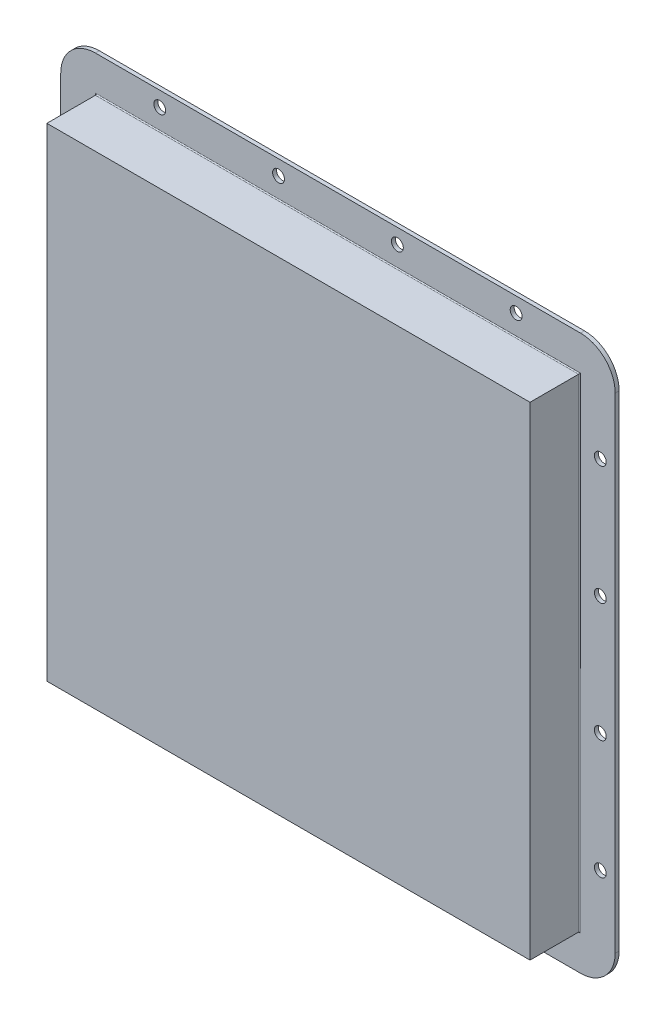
ISO-10303-21;
HEADER;
FILE_DESCRIPTION(('STEP AP214'),'2;1');
FILE_NAME('part.step','',(''),(''),'','','');
FILE_SCHEMA(('AUTOMOTIVE_DESIGN { 1 0 10303 214 1 1 1 1 }'));
ENDSEC;
DATA;
#1=APPLICATION_CONTEXT('core data for automotive mechanical design processes');
#2=APPLICATION_PROTOCOL_DEFINITION('international standard','automotive_design',2000,#1);
#3=PRODUCT_CONTEXT('',#1,'mechanical');
#4=PRODUCT('Part','Part','',(#3));
#5=PRODUCT_RELATED_PRODUCT_CATEGORY('part','',(#4));
#6=PRODUCT_DEFINITION_FORMATION('','',#4);
#7=PRODUCT_DEFINITION_CONTEXT('part definition',#1,'design');
#8=PRODUCT_DEFINITION('design','',#6,#7);
#9=PRODUCT_DEFINITION_SHAPE('','',#8);
#10=(LENGTH_UNIT() NAMED_UNIT(*) SI_UNIT(.MILLI.,.METRE.));
#11=(NAMED_UNIT(*) PLANE_ANGLE_UNIT() SI_UNIT($,.RADIAN.));
#12=(NAMED_UNIT(*) SI_UNIT($,.STERADIAN.) SOLID_ANGLE_UNIT());
#13=UNCERTAINTY_MEASURE_WITH_UNIT(LENGTH_MEASURE(1.E-05),#10,'distance_accuracy_value','');
#14=(GEOMETRIC_REPRESENTATION_CONTEXT(3) GLOBAL_UNCERTAINTY_ASSIGNED_CONTEXT((#13)) GLOBAL_UNIT_ASSIGNED_CONTEXT((#10,
#11,#12)) REPRESENTATION_CONTEXT('',''));
#15=CARTESIAN_POINT('',(0.,0.,0.));
#16=DIRECTION('',(0.,0.,1.));
#17=DIRECTION('',(1.,0.,0.));
#18=AXIS2_PLACEMENT_3D('',#15,#16,#17);
#19=CARTESIAN_POINT('',(0.,0.,0.));
#20=DIRECTION('',(0.,0.,-1.));
#21=DIRECTION('',(-1.,0.,0.));
#22=AXIS2_PLACEMENT_3D('',#19,#20,#21);
#23=PLANE('',#22);
#24=CARTESIAN_POINT('',(-75.,120.,0.));
#25=DIRECTION('',(0.,0.,-1.));
#26=DIRECTION('',(1.,0.,0.));
#27=AXIS2_PLACEMENT_3D('',#24,#25,#26);
#28=CIRCLE('',#27,5.00000000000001);
#29=CARTESIAN_POINT('',(-70.,120.,0.));
#30=VERTEX_POINT('',#29);
#31=EDGE_CURVE('E478',#30,#30,#28,.F.);
#32=ORIENTED_EDGE('',*,*,#31,.T.);
#33=EDGE_LOOP('',(#32));
#34=FACE_BOUND('',#33,.T.);
#35=CARTESIAN_POINT('',(75.,120.,0.));
#36=DIRECTION('',(0.,0.,1.));
#37=DIRECTION('',(-1.,0.,0.));
#38=AXIS2_PLACEMENT_3D('',#35,#36,#37);
#39=CIRCLE('',#38,5.00000000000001);
#40=CARTESIAN_POINT('',(70.,120.,0.));
#41=VERTEX_POINT('',#40);
#42=EDGE_CURVE('E463',#41,#41,#39,.F.);
#43=ORIENTED_EDGE('',*,*,#42,.F.);
#44=EDGE_LOOP('',(#43));
#45=FACE_BOUND('',#44,.T.);
#46=CARTESIAN_POINT('',(75.,-120.,0.));
#47=DIRECTION('',(0.,0.,-1.));
#48=DIRECTION('',(-1.,0.,0.));
#49=AXIS2_PLACEMENT_3D('',#46,#47,#48);
#50=CIRCLE('',#49,5.00000000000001);
#51=CARTESIAN_POINT('',(70.,-120.,0.));
#52=VERTEX_POINT('',#51);
#53=EDGE_CURVE('E11',#52,#52,#50,.T.);
#54=ORIENTED_EDGE('',*,*,#53,.F.);
#55=EDGE_LOOP('',(#54));
#56=FACE_BOUND('',#55,.T.);
#57=DIRECTION('',(0.,-1.,0.));
#58=VECTOR('',#57,1.);
#59=CARTESIAN_POINT('',(240.,-240.,0.));
#60=LINE('',#59,#58);
#61=CARTESIAN_POINT('',(240.,240.,0.));
#62=VERTEX_POINT('',#61);
#63=CARTESIAN_POINT('',(240.,-240.,0.));
#64=VERTEX_POINT('',#63);
#65=EDGE_CURVE('E341',#62,#64,#60,.T.);
#66=ORIENTED_EDGE('',*,*,#65,.T.);
#67=DIRECTION('',(-1.,0.,0.));
#68=VECTOR('',#67,1.);
#69=CARTESIAN_POINT('',(240.,-240.,0.));
#70=LINE('',#69,#68);
#71=CARTESIAN_POINT('',(-240.,-240.,0.));
#72=VERTEX_POINT('',#71);
#73=EDGE_CURVE('E194',#64,#72,#70,.T.);
#74=ORIENTED_EDGE('',*,*,#73,.T.);
#75=DIRECTION('',(0.,1.,0.));
#76=VECTOR('',#75,1.);
#77=CARTESIAN_POINT('',(-240.,-240.,0.));
#78=LINE('',#77,#76);
#79=CARTESIAN_POINT('',(-240.,240.,0.));
#80=VERTEX_POINT('',#79);
#81=EDGE_CURVE('E177',#72,#80,#78,.T.);
#82=ORIENTED_EDGE('',*,*,#81,.T.);
#83=DIRECTION('',(1.,0.,0.));
#84=VECTOR('',#83,1.);
#85=CARTESIAN_POINT('',(240.,240.,0.));
#86=LINE('',#85,#84);
#87=EDGE_CURVE('E191',#80,#62,#86,.T.);
#88=ORIENTED_EDGE('',*,*,#87,.T.);
#89=EDGE_LOOP('',(#66,#74,#82,#88));
#90=FACE_BOUND('',#89,.T.);
#91=CARTESIAN_POINT('',(-75.,-120.,0.));
#92=DIRECTION('',(0.,0.,1.));
#93=DIRECTION('',(1.,0.,0.));
#94=AXIS2_PLACEMENT_3D('',#91,#92,#93);
#95=CIRCLE('',#94,5.00000000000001);
#96=CARTESIAN_POINT('',(-70.,-120.,0.));
#97=VERTEX_POINT('',#96);
#98=EDGE_CURVE('E460',#97,#97,#95,.T.);
#99=ORIENTED_EDGE('',*,*,#98,.T.);
#100=EDGE_LOOP('',(#99));
#101=FACE_BOUND('',#100,.T.);
#102=ADVANCED_FACE('F33',(#34,#45,#56,#90,#101),#23,.T.);
#103=CARTESIAN_POINT('',(0.,0.,-50.));
#104=DIRECTION('',(0.,0.,1.));
#105=DIRECTION('',(1.,0.,0.));
#106=AXIS2_PLACEMENT_3D('',#103,#104,#105);
#107=PLANE('',#106);
#108=CARTESIAN_POINT('',(180.,-265.,-50.));
#109=DIRECTION('',(0.,0.,-1.));
#110=DIRECTION('',(-1.,0.,0.));
#111=AXIS2_PLACEMENT_3D('',#108,#109,#110);
#112=CIRCLE('',#111,5.99999999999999);
#113=CARTESIAN_POINT('',(174.,-265.,-50.));
#114=VERTEX_POINT('',#113);
#115=EDGE_CURVE('E420',#114,#114,#112,.T.);
#116=ORIENTED_EDGE('',*,*,#115,.F.);
#117=EDGE_LOOP('',(#116));
#118=FACE_BOUND('',#117,.T.);
#119=CARTESIAN_POINT('',(265.,-180.,-50.));
#120=DIRECTION('',(0.,0.,-1.));
#121=DIRECTION('',(-1.,0.,0.));
#122=AXIS2_PLACEMENT_3D('',#119,#120,#121);
#123=CIRCLE('',#122,5.99999999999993);
#124=CARTESIAN_POINT('',(259.,-180.,-50.));
#125=VERTEX_POINT('',#124);
#126=EDGE_CURVE('E414',#125,#125,#123,.T.);
#127=ORIENTED_EDGE('',*,*,#126,.F.);
#128=EDGE_LOOP('',(#127));
#129=FACE_BOUND('',#128,.T.);
#130=CARTESIAN_POINT('',(265.,-60.,-50.));
#131=DIRECTION('',(0.,0.,-1.));
#132=DIRECTION('',(-1.,0.,0.));
#133=AXIS2_PLACEMENT_3D('',#130,#131,#132);
#134=CIRCLE('',#133,5.99999999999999);
#135=CARTESIAN_POINT('',(259.,-60.,-50.));
#136=VERTEX_POINT('',#135);
#137=EDGE_CURVE('E408',#136,#136,#134,.T.);
#138=ORIENTED_EDGE('',*,*,#137,.F.);
#139=EDGE_LOOP('',(#138));
#140=FACE_BOUND('',#139,.T.);
#141=CARTESIAN_POINT('',(265.,60.,-50.));
#142=DIRECTION('',(0.,0.,-1.));
#143=DIRECTION('',(-1.,0.,0.));
#144=AXIS2_PLACEMENT_3D('',#141,#142,#143);
#145=CIRCLE('',#144,6.00000000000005);
#146=CARTESIAN_POINT('',(259.,60.,-50.));
#147=VERTEX_POINT('',#146);
#148=EDGE_CURVE('E401',#147,#147,#145,.T.);
#149=ORIENTED_EDGE('',*,*,#148,.F.);
#150=EDGE_LOOP('',(#149));
#151=FACE_BOUND('',#150,.T.);
#152=CARTESIAN_POINT('',(265.,180.,-50.));
#153=DIRECTION('',(0.,0.,-1.));
#154=DIRECTION('',(-1.,0.,0.));
#155=AXIS2_PLACEMENT_3D('',#152,#153,#154);
#156=CIRCLE('',#155,6.00000000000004);
#157=CARTESIAN_POINT('',(259.,180.,-50.));
#158=VERTEX_POINT('',#157);
#159=EDGE_CURVE('E444',#158,#158,#156,.T.);
#160=ORIENTED_EDGE('',*,*,#159,.F.);
#161=EDGE_LOOP('',(#160));
#162=FACE_BOUND('',#161,.T.);
#163=CARTESIAN_POINT('',(60.,-265.,-50.));
#164=DIRECTION('',(0.,0.,-1.));
#165=DIRECTION('',(-1.,0.,0.));
#166=AXIS2_PLACEMENT_3D('',#163,#164,#165);
#167=CIRCLE('',#166,6.00000000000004);
#168=CARTESIAN_POINT('',(54.,-265.,-50.));
#169=VERTEX_POINT('',#168);
#170=EDGE_CURVE('E438',#169,#169,#167,.T.);
#171=ORIENTED_EDGE('',*,*,#170,.F.);
#172=EDGE_LOOP('',(#171));
#173=FACE_BOUND('',#172,.T.);
#174=CARTESIAN_POINT('',(-60.,-265.,-50.));
#175=DIRECTION('',(0.,0.,-1.));
#176=DIRECTION('',(-1.,0.,0.));
#177=AXIS2_PLACEMENT_3D('',#174,#175,#176);
#178=CIRCLE('',#177,6.00000000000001);
#179=CARTESIAN_POINT('',(-66.,-265.,-50.));
#180=VERTEX_POINT('',#179);
#181=EDGE_CURVE('E432',#180,#180,#178,.T.);
#182=ORIENTED_EDGE('',*,*,#181,.F.);
#183=EDGE_LOOP('',(#182));
#184=FACE_BOUND('',#183,.T.);
#185=CARTESIAN_POINT('',(-180.,-265.,-50.));
#186=DIRECTION('',(0.,0.,-1.));
#187=DIRECTION('',(-1.,0.,0.));
#188=AXIS2_PLACEMENT_3D('',#185,#186,#187);
#189=CIRCLE('',#188,6.00000000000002);
#190=CARTESIAN_POINT('',(-186.,-265.,-50.));
#191=VERTEX_POINT('',#190);
#192=EDGE_CURVE('E425',#191,#191,#189,.T.);
#193=ORIENTED_EDGE('',*,*,#192,.F.);
#194=EDGE_LOOP('',(#193));
#195=FACE_BOUND('',#194,.T.);
#196=CARTESIAN_POINT('',(-265.,180.,-50.));
#197=DIRECTION('',(0.,0.,-1.));
#198=DIRECTION('',(-1.,0.,0.));
#199=AXIS2_PLACEMENT_3D('',#196,#197,#198);
#200=CIRCLE('',#199,5.99999999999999);
#201=CARTESIAN_POINT('',(-271.,180.,-50.));
#202=VERTEX_POINT('',#201);
#203=EDGE_CURVE('E372',#202,#202,#200,.T.);
#204=ORIENTED_EDGE('',*,*,#203,.F.);
#205=EDGE_LOOP('',(#204));
#206=FACE_BOUND('',#205,.T.);
#207=CARTESIAN_POINT('',(-265.,60.,-50.));
#208=DIRECTION('',(0.,0.,-1.));
#209=DIRECTION('',(-1.,0.,0.));
#210=AXIS2_PLACEMENT_3D('',#207,#208,#209);
#211=CIRCLE('',#210,5.99999999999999);
#212=CARTESIAN_POINT('',(-271.,60.,-50.));
#213=VERTEX_POINT('',#212);
#214=EDGE_CURVE('E366',#213,#213,#211,.T.);
#215=ORIENTED_EDGE('',*,*,#214,.F.);
#216=EDGE_LOOP('',(#215));
#217=FACE_BOUND('',#216,.T.);
#218=CARTESIAN_POINT('',(-265.,-60.,-50.));
#219=DIRECTION('',(0.,0.,-1.));
#220=DIRECTION('',(-1.,0.,0.));
#221=AXIS2_PLACEMENT_3D('',#218,#219,#220);
#222=CIRCLE('',#221,5.99999999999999);
#223=CARTESIAN_POINT('',(-271.,-60.,-50.));
#224=VERTEX_POINT('',#223);
#225=EDGE_CURVE('E359',#224,#224,#222,.T.);
#226=ORIENTED_EDGE('',*,*,#225,.F.);
#227=EDGE_LOOP('',(#226));
#228=FACE_BOUND('',#227,.T.);
#229=CARTESIAN_POINT('',(-265.,-180.,-50.));
#230=DIRECTION('',(0.,0.,-1.));
#231=DIRECTION('',(-1.,0.,0.));
#232=AXIS2_PLACEMENT_3D('',#229,#230,#231);
#233=CIRCLE('',#232,5.99999999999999);
#234=CARTESIAN_POINT('',(-271.,-180.,-50.));
#235=VERTEX_POINT('',#234);
#236=EDGE_CURVE('E396',#235,#235,#233,.T.);
#237=ORIENTED_EDGE('',*,*,#236,.F.);
#238=EDGE_LOOP('',(#237));
#239=FACE_BOUND('',#238,.T.);
#240=CARTESIAN_POINT('',(-60.,264.999999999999,-50.));
#241=DIRECTION('',(0.,0.,-1.));
#242=DIRECTION('',(-1.,0.,0.));
#243=AXIS2_PLACEMENT_3D('',#240,#241,#242);
#244=CIRCLE('',#243,6.00000000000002);
#245=CARTESIAN_POINT('',(-66.,264.999999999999,-50.));
#246=VERTEX_POINT('',#245);
#247=EDGE_CURVE('E390',#246,#246,#244,.T.);
#248=ORIENTED_EDGE('',*,*,#247,.F.);
#249=EDGE_LOOP('',(#248));
#250=FACE_BOUND('',#249,.T.);
#251=CARTESIAN_POINT('',(60.,264.999999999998,-50.));
#252=DIRECTION('',(0.,0.,-1.));
#253=DIRECTION('',(-1.,0.,0.));
#254=AXIS2_PLACEMENT_3D('',#251,#252,#253);
#255=CIRCLE('',#254,6.00000000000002);
#256=CARTESIAN_POINT('',(54.,264.999999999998,-50.));
#257=VERTEX_POINT('',#256);
#258=EDGE_CURVE('E384',#257,#257,#255,.T.);
#259=ORIENTED_EDGE('',*,*,#258,.F.);
#260=EDGE_LOOP('',(#259));
#261=FACE_BOUND('',#260,.T.);
#262=CARTESIAN_POINT('',(180.,264.999999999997,-50.));
#263=DIRECTION('',(0.,0.,-1.));
#264=DIRECTION('',(-1.,0.,0.));
#265=AXIS2_PLACEMENT_3D('',#262,#263,#264);
#266=CIRCLE('',#265,6.00000000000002);
#267=CARTESIAN_POINT('',(174.,264.999999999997,-50.));
#268=VERTEX_POINT('',#267);
#269=EDGE_CURVE('E377',#268,#268,#266,.T.);
#270=ORIENTED_EDGE('',*,*,#269,.F.);
#271=EDGE_LOOP('',(#270));
#272=FACE_BOUND('',#271,.T.);
#273=CARTESIAN_POINT('',(-180.,265.,-50.));
#274=DIRECTION('',(0.,0.,-1.));
#275=DIRECTION('',(-1.,0.,0.));
#276=AXIS2_PLACEMENT_3D('',#273,#274,#275);
#277=CIRCLE('',#276,6.00000000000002);
#278=CARTESIAN_POINT('',(-186.,265.,-50.));
#279=VERTEX_POINT('',#278);
#280=EDGE_CURVE('E353',#279,#279,#277,.T.);
#281=ORIENTED_EDGE('',*,*,#280,.F.);
#282=EDGE_LOOP('',(#281));
#283=FACE_BOUND('',#282,.T.);
#284=DIRECTION('',(0.,1.,0.));
#285=VECTOR('',#284,1.);
#286=CARTESIAN_POINT('',(-245.,-240.,-50.));
#287=LINE('',#286,#285);
#288=CARTESIAN_POINT('',(-245.,245.,-50.));
#289=VERTEX_POINT('',#288);
#290=CARTESIAN_POINT('',(-245.,-245.,-50.));
#291=VERTEX_POINT('',#290);
#292=EDGE_CURVE('E234',#289,#291,#287,.F.);
#293=ORIENTED_EDGE('',*,*,#292,.T.);
#294=DIRECTION('',(-1.,0.,0.));
#295=VECTOR('',#294,1.);
#296=CARTESIAN_POINT('',(240.,-245.,-50.));
#297=LINE('',#296,#295);
#298=CARTESIAN_POINT('',(245.,-245.,-50.));
#299=VERTEX_POINT('',#298);
#300=EDGE_CURVE('E236',#291,#299,#297,.F.);
#301=ORIENTED_EDGE('',*,*,#300,.T.);
#302=DIRECTION('',(0.,-1.,0.));
#303=VECTOR('',#302,1.);
#304=CARTESIAN_POINT('',(245.,240.,-50.));
#305=LINE('',#304,#303);
#306=CARTESIAN_POINT('',(245.,245.,-50.));
#307=VERTEX_POINT('',#306);
#308=EDGE_CURVE('E232',#299,#307,#305,.F.);
#309=ORIENTED_EDGE('',*,*,#308,.T.);
#310=DIRECTION('',(1.,0.,0.));
#311=VECTOR('',#310,1.);
#312=CARTESIAN_POINT('',(-240.,245.,-50.));
#313=LINE('',#312,#311);
#314=EDGE_CURVE('E230',#307,#289,#313,.F.);
#315=ORIENTED_EDGE('',*,*,#314,.T.);
#316=EDGE_LOOP('',(#293,#301,#309,#315));
#317=FACE_BOUND('',#316,.T.);
#318=DIRECTION('',(0.,1.,0.));
#319=VECTOR('',#318,1.);
#320=CARTESIAN_POINT('',(-280.,-280.,-50.));
#321=LINE('',#320,#319);
#322=CARTESIAN_POINT('',(-280.,-245.,-50.));
#323=VERTEX_POINT('',#322);
#324=CARTESIAN_POINT('',(-280.,245.,-50.));
#325=VERTEX_POINT('',#324);
#326=EDGE_CURVE('E329',#323,#325,#321,.T.);
#327=ORIENTED_EDGE('',*,*,#326,.T.);
#328=CARTESIAN_POINT('',(-245.,245.,-50.));
#329=DIRECTION('',(0.,0.,1.));
#330=DIRECTION('',(1.,0.,0.));
#331=AXIS2_PLACEMENT_3D('',#328,#329,#330);
#332=CIRCLE('',#331,35.);
#333=CARTESIAN_POINT('',(-245.,280.,-50.));
#334=VERTEX_POINT('',#333);
#335=EDGE_CURVE('E295',#325,#334,#332,.F.);
#336=ORIENTED_EDGE('',*,*,#335,.T.);
#337=DIRECTION('',(1.,0.,0.));
#338=VECTOR('',#337,1.);
#339=CARTESIAN_POINT('',(280.,280.,-50.));
#340=LINE('',#339,#338);
#341=CARTESIAN_POINT('',(245.,280.,-50.));
#342=VERTEX_POINT('',#341);
#343=EDGE_CURVE('E331',#334,#342,#340,.T.);
#344=ORIENTED_EDGE('',*,*,#343,.T.);
#345=CARTESIAN_POINT('',(245.,245.,-50.));
#346=DIRECTION('',(0.,0.,1.));
#347=DIRECTION('',(1.,0.,0.));
#348=AXIS2_PLACEMENT_3D('',#345,#346,#347);
#349=CIRCLE('',#348,35.);
#350=CARTESIAN_POINT('',(280.,245.,-50.));
#351=VERTEX_POINT('',#350);
#352=EDGE_CURVE('E293',#342,#351,#349,.F.);
#353=ORIENTED_EDGE('',*,*,#352,.T.);
#354=DIRECTION('',(0.,-1.,0.));
#355=VECTOR('',#354,1.);
#356=CARTESIAN_POINT('',(280.,-280.,-50.));
#357=LINE('',#356,#355);
#358=CARTESIAN_POINT('',(280.,-245.,-50.));
#359=VERTEX_POINT('',#358);
#360=EDGE_CURVE('E339',#351,#359,#357,.T.);
#361=ORIENTED_EDGE('',*,*,#360,.T.);
#362=CARTESIAN_POINT('',(245.,-245.,-50.));
#363=DIRECTION('',(0.,0.,1.));
#364=DIRECTION('',(1.,0.,0.));
#365=AXIS2_PLACEMENT_3D('',#362,#363,#364);
#366=CIRCLE('',#365,35.);
#367=CARTESIAN_POINT('',(245.,-280.,-50.));
#368=VERTEX_POINT('',#367);
#369=EDGE_CURVE('E289',#359,#368,#366,.F.);
#370=ORIENTED_EDGE('',*,*,#369,.T.);
#371=DIRECTION('',(-1.,0.,0.));
#372=VECTOR('',#371,1.);
#373=CARTESIAN_POINT('',(280.,-280.,-50.));
#374=LINE('',#373,#372);
#375=CARTESIAN_POINT('',(-245.,-280.,-50.));
#376=VERTEX_POINT('',#375);
#377=EDGE_CURVE('E256',#368,#376,#374,.T.);
#378=ORIENTED_EDGE('',*,*,#377,.T.);
#379=CARTESIAN_POINT('',(-245.,-245.,-50.));
#380=DIRECTION('',(0.,0.,1.));
#381=DIRECTION('',(1.,0.,0.));
#382=AXIS2_PLACEMENT_3D('',#379,#380,#381);
#383=CIRCLE('',#382,35.);
#384=EDGE_CURVE('E291',#376,#323,#383,.F.);
#385=ORIENTED_EDGE('',*,*,#384,.T.);
#386=EDGE_LOOP('',(#327,#336,#344,#353,#361,#370,#378,#385));
#387=FACE_BOUND('',#386,.T.);
#388=ADVANCED_FACE('F326',(#118,#129,#140,#151,#162,#173,#184,#195,#206,#217,#228,#239,#250,
#261,#272,#283,#317,#387),#107,.F.);
#389=CARTESIAN_POINT('',(240.,-240.,-50.));
#390=DIRECTION('',(-1.,0.,0.));
#391=DIRECTION('',(0.,0.,1.));
#392=AXIS2_PLACEMENT_3D('',#389,#390,#391);
#393=PLANE('',#392);
#394=DIRECTION('',(0.,0.,1.));
#395=VECTOR('',#394,1.);
#396=CARTESIAN_POINT('',(240.,240.,-50.));
#397=LINE('',#396,#395);
#398=CARTESIAN_POINT('',(240.,240.,-45.));
#399=VERTEX_POINT('',#398);
#400=EDGE_CURVE('E184',#399,#62,#397,.T.);
#401=ORIENTED_EDGE('',*,*,#400,.F.);
#402=DIRECTION('',(0.,-1.,0.));
#403=VECTOR('',#402,1.);
#404=CARTESIAN_POINT('',(240.,-240.,-45.));
#405=LINE('',#404,#403);
#406=CARTESIAN_POINT('',(240.,-240.,-45.));
#407=VERTEX_POINT('',#406);
#408=EDGE_CURVE('E240',#399,#407,#405,.T.);
#409=ORIENTED_EDGE('',*,*,#408,.T.);
#410=DIRECTION('',(0.,0.,1.));
#411=VECTOR('',#410,1.);
#412=CARTESIAN_POINT('',(240.,-240.,-50.));
#413=LINE('',#412,#411);
#414=EDGE_CURVE('E203',#407,#64,#413,.T.);
#415=ORIENTED_EDGE('',*,*,#414,.T.);
#416=ORIENTED_EDGE('',*,*,#65,.F.);
#417=EDGE_LOOP('',(#401,#409,#415,#416));
#418=FACE_BOUND('',#417,.T.);
#419=ADVANCED_FACE('F506',(#418),#393,.T.);
#420=CARTESIAN_POINT('',(240.,-240.,-50.));
#421=DIRECTION('',(0.,1.,0.));
#422=DIRECTION('',(0.,0.,1.));
#423=AXIS2_PLACEMENT_3D('',#420,#421,#422);
#424=PLANE('',#423);
#425=ORIENTED_EDGE('',*,*,#414,.F.);
#426=DIRECTION('',(-1.,0.,0.));
#427=VECTOR('',#426,1.);
#428=CARTESIAN_POINT('',(-240.,-240.,-45.));
#429=LINE('',#428,#427);
#430=CARTESIAN_POINT('',(-240.,-240.,-45.));
#431=VERTEX_POINT('',#430);
#432=EDGE_CURVE('E219',#407,#431,#429,.T.);
#433=ORIENTED_EDGE('',*,*,#432,.T.);
#434=DIRECTION('',(0.,0.,1.));
#435=VECTOR('',#434,1.);
#436=CARTESIAN_POINT('',(-240.,-240.,-50.));
#437=LINE('',#436,#435);
#438=EDGE_CURVE('E183',#431,#72,#437,.T.);
#439=ORIENTED_EDGE('',*,*,#438,.T.);
#440=ORIENTED_EDGE('',*,*,#73,.F.);
#441=EDGE_LOOP('',(#425,#433,#439,#440));
#442=FACE_BOUND('',#441,.T.);
#443=ADVANCED_FACE('F603',(#442),#424,.T.);
#444=CARTESIAN_POINT('',(-240.,-240.,-50.));
#445=DIRECTION('',(1.,0.,0.));
#446=DIRECTION('',(0.,0.,-1.));
#447=AXIS2_PLACEMENT_3D('',#444,#445,#446);
#448=PLANE('',#447);
#449=ORIENTED_EDGE('',*,*,#438,.F.);
#450=DIRECTION('',(0.,1.,0.));
#451=VECTOR('',#450,1.);
#452=CARTESIAN_POINT('',(-240.,240.,-45.));
#453=LINE('',#452,#451);
#454=CARTESIAN_POINT('',(-240.,240.,-45.));
#455=VERTEX_POINT('',#454);
#456=EDGE_CURVE('E179',#431,#455,#453,.T.);
#457=ORIENTED_EDGE('',*,*,#456,.T.);
#458=DIRECTION('',(0.,0.,1.));
#459=VECTOR('',#458,1.);
#460=CARTESIAN_POINT('',(-240.,240.,-50.));
#461=LINE('',#460,#459);
#462=EDGE_CURVE('E173',#455,#80,#461,.T.);
#463=ORIENTED_EDGE('',*,*,#462,.T.);
#464=ORIENTED_EDGE('',*,*,#81,.F.);
#465=EDGE_LOOP('',(#449,#457,#463,#464));
#466=FACE_BOUND('',#465,.T.);
#467=ADVANCED_FACE('F176',(#466),#448,.T.);
#468=CARTESIAN_POINT('',(240.,240.,-50.));
#469=DIRECTION('',(0.,-1.,0.));
#470=DIRECTION('',(0.,0.,-1.));
#471=AXIS2_PLACEMENT_3D('',#468,#469,#470);
#472=PLANE('',#471);
#473=ORIENTED_EDGE('',*,*,#462,.F.);
#474=DIRECTION('',(1.,0.,0.));
#475=VECTOR('',#474,1.);
#476=CARTESIAN_POINT('',(240.,240.,-45.));
#477=LINE('',#476,#475);
#478=EDGE_CURVE('E242',#455,#399,#477,.T.);
#479=ORIENTED_EDGE('',*,*,#478,.T.);
#480=ORIENTED_EDGE('',*,*,#400,.T.);
#481=ORIENTED_EDGE('',*,*,#87,.F.);
#482=EDGE_LOOP('',(#473,#479,#480,#481));
#483=FACE_BOUND('',#482,.T.);
#484=ADVANCED_FACE('F196',(#483),#472,.T.);
#485=CARTESIAN_POINT('',(280.,-280.,-46.));
#486=DIRECTION('',(0.,-1.,0.));
#487=DIRECTION('',(0.,0.,-1.));
#488=AXIS2_PLACEMENT_3D('',#485,#486,#487);
#489=PLANE('',#488);
#490=DIRECTION('',(-1.,0.,0.));
#491=VECTOR('',#490,1.);
#492=CARTESIAN_POINT('',(280.,-280.,-46.));
#493=LINE('',#492,#491);
#494=CARTESIAN_POINT('',(245.,-280.,-46.));
#495=VERTEX_POINT('',#494);
#496=CARTESIAN_POINT('',(-245.,-280.,-46.));
#497=VERTEX_POINT('',#496);
#498=EDGE_CURVE('E321',#495,#497,#493,.T.);
#499=ORIENTED_EDGE('',*,*,#498,.T.);
#500=DIRECTION('',(0.,0.,-1.));
#501=VECTOR('',#500,1.);
#502=CARTESIAN_POINT('',(-245.,-280.,-46.));
#503=LINE('',#502,#501);
#504=EDGE_CURVE('E37',#497,#376,#503,.T.);
#505=ORIENTED_EDGE('',*,*,#504,.T.);
#506=ORIENTED_EDGE('',*,*,#377,.F.);
#507=DIRECTION('',(0.,0.,-1.));
#508=VECTOR('',#507,1.);
#509=CARTESIAN_POINT('',(245.,-280.,-46.));
#510=LINE('',#509,#508);
#511=EDGE_CURVE('E312',#368,#495,#510,.F.);
#512=ORIENTED_EDGE('',*,*,#511,.T.);
#513=EDGE_LOOP('',(#499,#505,#506,#512));
#514=FACE_BOUND('',#513,.T.);
#515=ADVANCED_FACE('F320',(#514),#489,.T.);
#516=CARTESIAN_POINT('',(280.,-280.,-46.));
#517=DIRECTION('',(1.,0.,0.));
#518=DIRECTION('',(0.,0.,-1.));
#519=AXIS2_PLACEMENT_3D('',#516,#517,#518);
#520=PLANE('',#519);
#521=ORIENTED_EDGE('',*,*,#360,.F.);
#522=DIRECTION('',(0.,0.,-1.));
#523=VECTOR('',#522,1.);
#524=CARTESIAN_POINT('',(280.,245.,-46.));
#525=LINE('',#524,#523);
#526=CARTESIAN_POINT('',(280.,245.,-46.));
#527=VERTEX_POINT('',#526);
#528=EDGE_CURVE('E56',#351,#527,#525,.F.);
#529=ORIENTED_EDGE('',*,*,#528,.T.);
#530=DIRECTION('',(0.,-1.,0.));
#531=VECTOR('',#530,1.);
#532=CARTESIAN_POINT('',(280.,-280.,-46.));
#533=LINE('',#532,#531);
#534=CARTESIAN_POINT('',(280.,-245.,-46.));
#535=VERTEX_POINT('',#534);
#536=EDGE_CURVE('E334',#527,#535,#533,.T.);
#537=ORIENTED_EDGE('',*,*,#536,.T.);
#538=DIRECTION('',(0.,0.,-1.));
#539=VECTOR('',#538,1.);
#540=CARTESIAN_POINT('',(280.,-245.,-46.));
#541=LINE('',#540,#539);
#542=EDGE_CURVE('E309',#535,#359,#541,.T.);
#543=ORIENTED_EDGE('',*,*,#542,.T.);
#544=EDGE_LOOP('',(#521,#529,#537,#543));
#545=FACE_BOUND('',#544,.T.);
#546=ADVANCED_FACE('F585',(#545),#520,.T.);
#547=CARTESIAN_POINT('',(280.,280.,-46.));
#548=DIRECTION('',(0.,1.,0.));
#549=DIRECTION('',(-1.,0.,0.));
#550=AXIS2_PLACEMENT_3D('',#547,#548,#549);
#551=PLANE('',#550);
#552=ORIENTED_EDGE('',*,*,#343,.F.);
#553=DIRECTION('',(0.,0.,-1.));
#554=VECTOR('',#553,1.);
#555=CARTESIAN_POINT('',(-245.,280.,-46.));
#556=LINE('',#555,#554);
#557=CARTESIAN_POINT('',(-245.,280.,-46.));
#558=VERTEX_POINT('',#557);
#559=EDGE_CURVE('E300',#334,#558,#556,.F.);
#560=ORIENTED_EDGE('',*,*,#559,.T.);
#561=DIRECTION('',(1.,0.,0.));
#562=VECTOR('',#561,1.);
#563=CARTESIAN_POINT('',(280.,280.,-46.));
#564=LINE('',#563,#562);
#565=CARTESIAN_POINT('',(245.,280.,-46.));
#566=VERTEX_POINT('',#565);
#567=EDGE_CURVE('E342',#558,#566,#564,.T.);
#568=ORIENTED_EDGE('',*,*,#567,.T.);
#569=DIRECTION('',(0.,0.,-1.));
#570=VECTOR('',#569,1.);
#571=CARTESIAN_POINT('',(245.,280.,-46.));
#572=LINE('',#571,#570);
#573=EDGE_CURVE('E297',#566,#342,#572,.T.);
#574=ORIENTED_EDGE('',*,*,#573,.T.);
#575=EDGE_LOOP('',(#552,#560,#568,#574));
#576=FACE_BOUND('',#575,.T.);
#577=ADVANCED_FACE('F583',(#576),#551,.T.);
#578=CARTESIAN_POINT('',(-280.,-280.,-46.));
#579=DIRECTION('',(-1.,0.,0.));
#580=DIRECTION('',(0.,-1.,0.));
#581=AXIS2_PLACEMENT_3D('',#578,#579,#580);
#582=PLANE('',#581);
#583=DIRECTION('',(0.,1.,0.));
#584=VECTOR('',#583,1.);
#585=CARTESIAN_POINT('',(-280.,-280.,-46.));
#586=LINE('',#585,#584);
#587=CARTESIAN_POINT('',(-280.,-245.,-46.));
#588=VERTEX_POINT('',#587);
#589=CARTESIAN_POINT('',(-280.,245.,-46.));
#590=VERTEX_POINT('',#589);
#591=EDGE_CURVE('E345',#588,#590,#586,.T.);
#592=ORIENTED_EDGE('',*,*,#591,.T.);
#593=DIRECTION('',(0.,0.,-1.));
#594=VECTOR('',#593,1.);
#595=CARTESIAN_POINT('',(-280.,245.,-46.));
#596=LINE('',#595,#594);
#597=EDGE_CURVE('E286',#590,#325,#596,.T.);
#598=ORIENTED_EDGE('',*,*,#597,.T.);
#599=ORIENTED_EDGE('',*,*,#326,.F.);
#600=DIRECTION('',(0.,0.,-1.));
#601=VECTOR('',#600,1.);
#602=CARTESIAN_POINT('',(-280.,-245.,-46.));
#603=LINE('',#602,#601);
#604=EDGE_CURVE('E274',#323,#588,#603,.F.);
#605=ORIENTED_EDGE('',*,*,#604,.T.);
#606=EDGE_LOOP('',(#592,#598,#599,#605));
#607=FACE_BOUND('',#606,.T.);
#608=ADVANCED_FACE('F580',(#607),#582,.T.);
#609=CARTESIAN_POINT('',(0.,0.,-46.));
#610=DIRECTION('',(0.,0.,-1.));
#611=DIRECTION('',(-1.,0.,0.));
#612=AXIS2_PLACEMENT_3D('',#609,#610,#611);
#613=PLANE('',#612);
#614=CARTESIAN_POINT('',(180.,-265.,-46.));
#615=DIRECTION('',(0.,0.,-1.));
#616=DIRECTION('',(-1.,0.,0.));
#617=AXIS2_PLACEMENT_3D('',#614,#615,#616);
#618=CIRCLE('',#617,5.99999999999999);
#619=CARTESIAN_POINT('',(174.,-265.,-46.));
#620=VERTEX_POINT('',#619);
#621=EDGE_CURVE('E381',#620,#620,#618,.T.);
#622=ORIENTED_EDGE('',*,*,#621,.T.);
#623=EDGE_LOOP('',(#622));
#624=FACE_BOUND('',#623,.T.);
#625=CARTESIAN_POINT('',(265.,-180.,-46.));
#626=DIRECTION('',(0.,0.,-1.));
#627=DIRECTION('',(-1.,0.,0.));
#628=AXIS2_PLACEMENT_3D('',#625,#626,#627);
#629=CIRCLE('',#628,5.99999999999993);
#630=CARTESIAN_POINT('',(259.,-180.,-46.));
#631=VERTEX_POINT('',#630);
#632=EDGE_CURVE('E417',#631,#631,#629,.T.);
#633=ORIENTED_EDGE('',*,*,#632,.T.);
#634=EDGE_LOOP('',(#633));
#635=FACE_BOUND('',#634,.T.);
#636=CARTESIAN_POINT('',(265.,-60.,-46.));
#637=DIRECTION('',(0.,0.,-1.));
#638=DIRECTION('',(-1.,0.,0.));
#639=AXIS2_PLACEMENT_3D('',#636,#637,#638);
#640=CIRCLE('',#639,5.99999999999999);
#641=CARTESIAN_POINT('',(259.,-60.,-46.));
#642=VERTEX_POINT('',#641);
#643=EDGE_CURVE('E411',#642,#642,#640,.T.);
#644=ORIENTED_EDGE('',*,*,#643,.T.);
#645=EDGE_LOOP('',(#644));
#646=FACE_BOUND('',#645,.T.);
#647=CARTESIAN_POINT('',(265.,60.,-46.));
#648=DIRECTION('',(0.,0.,-1.));
#649=DIRECTION('',(-1.,0.,0.));
#650=AXIS2_PLACEMENT_3D('',#647,#648,#649);
#651=CIRCLE('',#650,6.00000000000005);
#652=CARTESIAN_POINT('',(259.,60.,-46.));
#653=VERTEX_POINT('',#652);
#654=EDGE_CURVE('E404',#653,#653,#651,.T.);
#655=ORIENTED_EDGE('',*,*,#654,.T.);
#656=EDGE_LOOP('',(#655));
#657=FACE_BOUND('',#656,.T.);
#658=CARTESIAN_POINT('',(265.,180.,-46.));
#659=DIRECTION('',(0.,0.,-1.));
#660=DIRECTION('',(-1.,0.,0.));
#661=AXIS2_PLACEMENT_3D('',#658,#659,#660);
#662=CIRCLE('',#661,6.00000000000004);
#663=CARTESIAN_POINT('',(259.,180.,-46.));
#664=VERTEX_POINT('',#663);
#665=EDGE_CURVE('E405',#664,#664,#662,.T.);
#666=ORIENTED_EDGE('',*,*,#665,.T.);
#667=EDGE_LOOP('',(#666));
#668=FACE_BOUND('',#667,.T.);
#669=CARTESIAN_POINT('',(60.,-265.,-46.));
#670=DIRECTION('',(0.,0.,-1.));
#671=DIRECTION('',(-1.,0.,0.));
#672=AXIS2_PLACEMENT_3D('',#669,#670,#671);
#673=CIRCLE('',#672,6.00000000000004);
#674=CARTESIAN_POINT('',(54.,-265.,-46.));
#675=VERTEX_POINT('',#674);
#676=EDGE_CURVE('E441',#675,#675,#673,.T.);
#677=ORIENTED_EDGE('',*,*,#676,.T.);
#678=EDGE_LOOP('',(#677));
#679=FACE_BOUND('',#678,.T.);
#680=CARTESIAN_POINT('',(-60.,-265.,-46.));
#681=DIRECTION('',(0.,0.,-1.));
#682=DIRECTION('',(-1.,0.,0.));
#683=AXIS2_PLACEMENT_3D('',#680,#681,#682);
#684=CIRCLE('',#683,6.00000000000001);
#685=CARTESIAN_POINT('',(-66.,-265.,-46.));
#686=VERTEX_POINT('',#685);
#687=EDGE_CURVE('E435',#686,#686,#684,.T.);
#688=ORIENTED_EDGE('',*,*,#687,.T.);
#689=EDGE_LOOP('',(#688));
#690=FACE_BOUND('',#689,.T.);
#691=CARTESIAN_POINT('',(-180.,-265.,-46.));
#692=DIRECTION('',(0.,0.,-1.));
#693=DIRECTION('',(-1.,0.,0.));
#694=AXIS2_PLACEMENT_3D('',#691,#692,#693);
#695=CIRCLE('',#694,6.00000000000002);
#696=CARTESIAN_POINT('',(-186.,-265.,-46.));
#697=VERTEX_POINT('',#696);
#698=EDGE_CURVE('E428',#697,#697,#695,.T.);
#699=ORIENTED_EDGE('',*,*,#698,.T.);
#700=EDGE_LOOP('',(#699));
#701=FACE_BOUND('',#700,.T.);
#702=CARTESIAN_POINT('',(-265.,180.,-46.));
#703=DIRECTION('',(0.,0.,-1.));
#704=DIRECTION('',(-1.,0.,0.));
#705=AXIS2_PLACEMENT_3D('',#702,#703,#704);
#706=CIRCLE('',#705,5.99999999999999);
#707=CARTESIAN_POINT('',(-271.,180.,-46.));
#708=VERTEX_POINT('',#707);
#709=EDGE_CURVE('E356',#708,#708,#706,.T.);
#710=ORIENTED_EDGE('',*,*,#709,.T.);
#711=EDGE_LOOP('',(#710));
#712=FACE_BOUND('',#711,.T.);
#713=CARTESIAN_POINT('',(-265.,60.,-46.));
#714=DIRECTION('',(0.,0.,-1.));
#715=DIRECTION('',(-1.,0.,0.));
#716=AXIS2_PLACEMENT_3D('',#713,#714,#715);
#717=CIRCLE('',#716,5.99999999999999);
#718=CARTESIAN_POINT('',(-271.,60.,-46.));
#719=VERTEX_POINT('',#718);
#720=EDGE_CURVE('E369',#719,#719,#717,.T.);
#721=ORIENTED_EDGE('',*,*,#720,.T.);
#722=EDGE_LOOP('',(#721));
#723=FACE_BOUND('',#722,.T.);
#724=CARTESIAN_POINT('',(-265.,-60.,-46.));
#725=DIRECTION('',(0.,0.,-1.));
#726=DIRECTION('',(-1.,0.,0.));
#727=AXIS2_PLACEMENT_3D('',#724,#725,#726);
#728=CIRCLE('',#727,5.99999999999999);
#729=CARTESIAN_POINT('',(-271.,-60.,-46.));
#730=VERTEX_POINT('',#729);
#731=EDGE_CURVE('E362',#730,#730,#728,.T.);
#732=ORIENTED_EDGE('',*,*,#731,.T.);
#733=EDGE_LOOP('',(#732));
#734=FACE_BOUND('',#733,.T.);
#735=CARTESIAN_POINT('',(-265.,-180.,-46.));
#736=DIRECTION('',(0.,0.,-1.));
#737=DIRECTION('',(-1.,0.,0.));
#738=AXIS2_PLACEMENT_3D('',#735,#736,#737);
#739=CIRCLE('',#738,5.99999999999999);
#740=CARTESIAN_POINT('',(-271.,-180.,-46.));
#741=VERTEX_POINT('',#740);
#742=EDGE_CURVE('E363',#741,#741,#739,.T.);
#743=ORIENTED_EDGE('',*,*,#742,.T.);
#744=EDGE_LOOP('',(#743));
#745=FACE_BOUND('',#744,.T.);
#746=CARTESIAN_POINT('',(-60.,264.999999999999,-46.));
#747=DIRECTION('',(0.,0.,-1.));
#748=DIRECTION('',(-1.,0.,0.));
#749=AXIS2_PLACEMENT_3D('',#746,#747,#748);
#750=CIRCLE('',#749,6.00000000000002);
#751=CARTESIAN_POINT('',(-66.,264.999999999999,-46.));
#752=VERTEX_POINT('',#751);
#753=EDGE_CURVE('E393',#752,#752,#750,.T.);
#754=ORIENTED_EDGE('',*,*,#753,.T.);
#755=EDGE_LOOP('',(#754));
#756=FACE_BOUND('',#755,.T.);
#757=CARTESIAN_POINT('',(60.,264.999999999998,-46.));
#758=DIRECTION('',(0.,0.,-1.));
#759=DIRECTION('',(-1.,0.,0.));
#760=AXIS2_PLACEMENT_3D('',#757,#758,#759);
#761=CIRCLE('',#760,6.00000000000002);
#762=CARTESIAN_POINT('',(54.,264.999999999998,-46.));
#763=VERTEX_POINT('',#762);
#764=EDGE_CURVE('E387',#763,#763,#761,.T.);
#765=ORIENTED_EDGE('',*,*,#764,.T.);
#766=EDGE_LOOP('',(#765));
#767=FACE_BOUND('',#766,.T.);
#768=CARTESIAN_POINT('',(180.,264.999999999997,-46.));
#769=DIRECTION('',(0.,0.,-1.));
#770=DIRECTION('',(-1.,0.,0.));
#771=AXIS2_PLACEMENT_3D('',#768,#769,#770);
#772=CIRCLE('',#771,6.00000000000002);
#773=CARTESIAN_POINT('',(174.,264.999999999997,-46.));
#774=VERTEX_POINT('',#773);
#775=EDGE_CURVE('E380',#774,#774,#772,.T.);
#776=ORIENTED_EDGE('',*,*,#775,.T.);
#777=EDGE_LOOP('',(#776));
#778=FACE_BOUND('',#777,.T.);
#779=CARTESIAN_POINT('',(-180.,265.,-46.));
#780=DIRECTION('',(0.,0.,-1.));
#781=DIRECTION('',(-1.,0.,0.));
#782=AXIS2_PLACEMENT_3D('',#779,#780,#781);
#783=CIRCLE('',#782,6.00000000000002);
#784=CARTESIAN_POINT('',(-186.,265.,-46.));
#785=VERTEX_POINT('',#784);
#786=EDGE_CURVE('E278',#785,#785,#783,.T.);
#787=ORIENTED_EDGE('',*,*,#786,.T.);
#788=EDGE_LOOP('',(#787));
#789=FACE_BOUND('',#788,.T.);
#790=DIRECTION('',(0.,1.,0.));
#791=VECTOR('',#790,1.);
#792=CARTESIAN_POINT('',(-245.,0.,-46.));
#793=LINE('',#792,#791);
#794=CARTESIAN_POINT('',(-245.,-245.,-46.));
#795=VERTEX_POINT('',#794);
#796=CARTESIAN_POINT('',(-245.,245.,-46.));
#797=VERTEX_POINT('',#796);
#798=EDGE_CURVE('E260',#795,#797,#793,.T.);
#799=ORIENTED_EDGE('',*,*,#798,.T.);
#800=DIRECTION('',(1.,0.,0.));
#801=VECTOR('',#800,1.);
#802=CARTESIAN_POINT('',(244.,245.,-46.));
#803=LINE('',#802,#801);
#804=CARTESIAN_POINT('',(245.,245.,-46.));
#805=VERTEX_POINT('',#804);
#806=EDGE_CURVE('E262',#797,#805,#803,.T.);
#807=ORIENTED_EDGE('',*,*,#806,.T.);
#808=DIRECTION('',(0.,-1.,0.));
#809=VECTOR('',#808,1.);
#810=CARTESIAN_POINT('',(245.,-244.,-46.));
#811=LINE('',#810,#809);
#812=CARTESIAN_POINT('',(245.,-245.,-46.));
#813=VERTEX_POINT('',#812);
#814=EDGE_CURVE('E258',#805,#813,#811,.T.);
#815=ORIENTED_EDGE('',*,*,#814,.T.);
#816=DIRECTION('',(-1.,0.,0.));
#817=VECTOR('',#816,1.);
#818=CARTESIAN_POINT('',(0.,-245.,-46.));
#819=LINE('',#818,#817);
#820=EDGE_CURVE('E244',#813,#795,#819,.T.);
#821=ORIENTED_EDGE('',*,*,#820,.T.);
#822=EDGE_LOOP('',(#799,#807,#815,#821));
#823=FACE_BOUND('',#822,.T.);
#824=ORIENTED_EDGE('',*,*,#567,.F.);
#825=CARTESIAN_POINT('',(-245.,245.,-46.));
#826=DIRECTION('',(0.,0.,-1.));
#827=DIRECTION('',(-1.,0.,0.));
#828=AXIS2_PLACEMENT_3D('',#825,#826,#827);
#829=CIRCLE('',#828,35.);
#830=EDGE_CURVE('E307',#558,#590,#829,.F.);
#831=ORIENTED_EDGE('',*,*,#830,.T.);
#832=ORIENTED_EDGE('',*,*,#591,.F.);
#833=CARTESIAN_POINT('',(-245.,-245.,-46.));
#834=DIRECTION('',(0.,0.,-1.));
#835=DIRECTION('',(-1.,0.,0.));
#836=AXIS2_PLACEMENT_3D('',#833,#834,#835);
#837=CIRCLE('',#836,35.);
#838=EDGE_CURVE('E303',#588,#497,#837,.F.);
#839=ORIENTED_EDGE('',*,*,#838,.T.);
#840=ORIENTED_EDGE('',*,*,#498,.F.);
#841=CARTESIAN_POINT('',(245.,-245.,-46.));
#842=DIRECTION('',(0.,0.,-1.));
#843=DIRECTION('',(-1.,0.,0.));
#844=AXIS2_PLACEMENT_3D('',#841,#842,#843);
#845=CIRCLE('',#844,35.);
#846=EDGE_CURVE('E49',#495,#535,#845,.F.);
#847=ORIENTED_EDGE('',*,*,#846,.T.);
#848=ORIENTED_EDGE('',*,*,#536,.F.);
#849=CARTESIAN_POINT('',(245.,245.,-46.));
#850=DIRECTION('',(0.,0.,-1.));
#851=DIRECTION('',(-1.,0.,0.));
#852=AXIS2_PLACEMENT_3D('',#849,#850,#851);
#853=CIRCLE('',#852,35.);
#854=EDGE_CURVE('E305',#527,#566,#853,.F.);
#855=ORIENTED_EDGE('',*,*,#854,.T.);
#856=EDGE_LOOP('',(#824,#831,#832,#839,#840,#847,#848,#855));
#857=FACE_BOUND('',#856,.T.);
#858=ADVANCED_FACE('F576',(#624,#635,#646,#657,#668,#679,#690,#701,#712,#723,#734,#745,#756,
#767,#778,#789,#823,#857),#613,.F.);
#859=CARTESIAN_POINT('',(0.,0.,4.));
#860=DIRECTION('',(0.,0.,-1.));
#861=DIRECTION('',(-1.,0.,0.));
#862=AXIS2_PLACEMENT_3D('',#859,#860,#861);
#863=PLANE('',#862);
#864=DIRECTION('',(-1.,0.,0.));
#865=VECTOR('',#864,1.);
#866=CARTESIAN_POINT('',(244.,-244.,4.));
#867=LINE('',#866,#865);
#868=CARTESIAN_POINT('',(244.,-244.,4.));
#869=VERTEX_POINT('',#868);
#870=CARTESIAN_POINT('',(-244.,-244.,4.));
#871=VERTEX_POINT('',#870);
#872=EDGE_CURVE('E205',#869,#871,#867,.T.);
#873=ORIENTED_EDGE('',*,*,#872,.F.);
#874=DIRECTION('',(0.,1.,0.));
#875=VECTOR('',#874,1.);
#876=CARTESIAN_POINT('',(244.,-244.,4.));
#877=LINE('',#876,#875);
#878=CARTESIAN_POINT('',(244.,244.,4.));
#879=VERTEX_POINT('',#878);
#880=EDGE_CURVE('E213',#869,#879,#877,.T.);
#881=ORIENTED_EDGE('',*,*,#880,.T.);
#882=DIRECTION('',(-1.,0.,0.));
#883=VECTOR('',#882,1.);
#884=CARTESIAN_POINT('',(244.,244.,4.));
#885=LINE('',#884,#883);
#886=CARTESIAN_POINT('',(-244.,244.,4.));
#887=VERTEX_POINT('',#886);
#888=EDGE_CURVE('E211',#879,#887,#885,.T.);
#889=ORIENTED_EDGE('',*,*,#888,.T.);
#890=DIRECTION('',(0.,1.,0.));
#891=VECTOR('',#890,1.);
#892=CARTESIAN_POINT('',(-244.,-244.,4.));
#893=LINE('',#892,#891);
#894=EDGE_CURVE('E208',#871,#887,#893,.T.);
#895=ORIENTED_EDGE('',*,*,#894,.F.);
#896=EDGE_LOOP('',(#873,#881,#889,#895));
#897=FACE_BOUND('',#896,.T.);
#898=ADVANCED_FACE('F511',(#897),#863,.F.);
#899=CARTESIAN_POINT('',(-244.,-244.,4.));
#900=DIRECTION('',(-1.,0.,0.));
#901=DIRECTION('',(0.,-1.,0.));
#902=AXIS2_PLACEMENT_3D('',#899,#900,#901);
#903=PLANE('',#902);
#904=DIRECTION('',(0.,0.,-1.));
#905=VECTOR('',#904,1.);
#906=CARTESIAN_POINT('',(-244.,244.,4.));
#907=LINE('',#906,#905);
#908=CARTESIAN_POINT('',(-244.,244.,-45.));
#909=VERTEX_POINT('',#908);
#910=EDGE_CURVE('E223',#887,#909,#907,.T.);
#911=ORIENTED_EDGE('',*,*,#910,.T.);
#912=DIRECTION('',(0.,1.,0.));
#913=VECTOR('',#912,1.);
#914=CARTESIAN_POINT('',(-244.,-244.,-45.));
#915=LINE('',#914,#913);
#916=CARTESIAN_POINT('',(-244.,-244.,-45.));
#917=VERTEX_POINT('',#916);
#918=EDGE_CURVE('E268',#909,#917,#915,.F.);
#919=ORIENTED_EDGE('',*,*,#918,.T.);
#920=DIRECTION('',(0.,0.,-1.));
#921=VECTOR('',#920,1.);
#922=CARTESIAN_POINT('',(-244.,-244.,4.));
#923=LINE('',#922,#921);
#924=EDGE_CURVE('E215',#871,#917,#923,.T.);
#925=ORIENTED_EDGE('',*,*,#924,.F.);
#926=ORIENTED_EDGE('',*,*,#894,.T.);
#927=EDGE_LOOP('',(#911,#919,#925,#926));
#928=FACE_BOUND('',#927,.T.);
#929=ADVANCED_FACE('F520',(#928),#903,.T.);
#930=CARTESIAN_POINT('',(244.,244.,4.));
#931=DIRECTION('',(0.,-1.,0.));
#932=DIRECTION('',(1.,0.,0.));
#933=AXIS2_PLACEMENT_3D('',#930,#931,#932);
#934=PLANE('',#933);
#935=DIRECTION('',(0.,0.,-1.));
#936=VECTOR('',#935,1.);
#937=CARTESIAN_POINT('',(244.,244.,4.));
#938=LINE('',#937,#936);
#939=CARTESIAN_POINT('',(244.,244.,-45.));
#940=VERTEX_POINT('',#939);
#941=EDGE_CURVE('E220',#879,#940,#938,.T.);
#942=ORIENTED_EDGE('',*,*,#941,.T.);
#943=DIRECTION('',(1.,0.,0.));
#944=VECTOR('',#943,1.);
#945=CARTESIAN_POINT('',(-244.,244.,-45.));
#946=LINE('',#945,#944);
#947=EDGE_CURVE('E265',#940,#909,#946,.F.);
#948=ORIENTED_EDGE('',*,*,#947,.T.);
#949=ORIENTED_EDGE('',*,*,#910,.F.);
#950=ORIENTED_EDGE('',*,*,#888,.F.);
#951=EDGE_LOOP('',(#942,#948,#949,#950));
#952=FACE_BOUND('',#951,.T.);
#953=ADVANCED_FACE('F516',(#952),#934,.F.);
#954=CARTESIAN_POINT('',(244.,-244.,4.));
#955=DIRECTION('',(-1.,0.,0.));
#956=DIRECTION('',(0.,0.,1.));
#957=AXIS2_PLACEMENT_3D('',#954,#955,#956);
#958=PLANE('',#957);
#959=DIRECTION('',(0.,0.,-1.));
#960=VECTOR('',#959,1.);
#961=CARTESIAN_POINT('',(244.,-244.,4.));
#962=LINE('',#961,#960);
#963=CARTESIAN_POINT('',(244.,-244.,-45.));
#964=VERTEX_POINT('',#963);
#965=EDGE_CURVE('E216',#869,#964,#962,.T.);
#966=ORIENTED_EDGE('',*,*,#965,.T.);
#967=DIRECTION('',(0.,-1.,0.));
#968=VECTOR('',#967,1.);
#969=CARTESIAN_POINT('',(244.,244.,-45.));
#970=LINE('',#969,#968);
#971=EDGE_CURVE('E270',#964,#940,#970,.F.);
#972=ORIENTED_EDGE('',*,*,#971,.T.);
#973=ORIENTED_EDGE('',*,*,#941,.F.);
#974=ORIENTED_EDGE('',*,*,#880,.F.);
#975=EDGE_LOOP('',(#966,#972,#973,#974));
#976=FACE_BOUND('',#975,.T.);
#977=ADVANCED_FACE('F512',(#976),#958,.F.);
#978=CARTESIAN_POINT('',(244.,-244.,4.));
#979=DIRECTION('',(0.,-1.,0.));
#980=DIRECTION('',(0.,0.,-1.));
#981=AXIS2_PLACEMENT_3D('',#978,#979,#980);
#982=PLANE('',#981);
#983=ORIENTED_EDGE('',*,*,#924,.T.);
#984=DIRECTION('',(-1.,0.,0.));
#985=VECTOR('',#984,1.);
#986=CARTESIAN_POINT('',(244.,-244.,-45.));
#987=LINE('',#986,#985);
#988=EDGE_CURVE('E272',#917,#964,#987,.F.);
#989=ORIENTED_EDGE('',*,*,#988,.T.);
#990=ORIENTED_EDGE('',*,*,#965,.F.);
#991=ORIENTED_EDGE('',*,*,#872,.T.);
#992=EDGE_LOOP('',(#983,#989,#990,#991));
#993=FACE_BOUND('',#992,.T.);
#994=ADVANCED_FACE('F515',(#993),#982,.T.);
#995=CARTESIAN_POINT('',(240.,245.,-45.));
#996=DIRECTION('',(-1.,0.,0.));
#997=DIRECTION('',(0.,0.,1.));
#998=AXIS2_PLACEMENT_3D('',#995,#996,#997);
#999=CYLINDRICAL_SURFACE('',#998,5.);
#1000=CARTESIAN_POINT('',(-245.,245.,-45.));
#1001=DIRECTION('',(-0.707106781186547,-0.707106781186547,0.));
#1002=DIRECTION('',(0.707106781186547,-0.707106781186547,0.));
#1003=AXIS2_PLACEMENT_3D('',#1000,#1001,#1002);
#1004=ELLIPSE('',#1003,7.07106781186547,5.);
#1005=EDGE_CURVE('E250',#289,#455,#1004,.T.);
#1006=ORIENTED_EDGE('',*,*,#1005,.F.);
#1007=ORIENTED_EDGE('',*,*,#314,.F.);
#1008=CARTESIAN_POINT('',(245.,245.,-45.));
#1009=DIRECTION('',(-0.707106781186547,0.707106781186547,0.));
#1010=DIRECTION('',(0.707106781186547,0.707106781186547,0.));
#1011=AXIS2_PLACEMENT_3D('',#1008,#1009,#1010);
#1012=ELLIPSE('',#1011,7.07106781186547,5.);
#1013=EDGE_CURVE('E253',#399,#307,#1012,.F.);
#1014=ORIENTED_EDGE('',*,*,#1013,.F.);
#1015=ORIENTED_EDGE('',*,*,#478,.F.);
#1016=EDGE_LOOP('',(#1006,#1007,#1014,#1015));
#1017=FACE_BOUND('',#1016,.T.);
#1018=ADVANCED_FACE('F527',(#1017),#999,.T.);
#1019=CARTESIAN_POINT('',(245.,-240.,-45.));
#1020=DIRECTION('',(0.,1.,0.));
#1021=DIRECTION('',(0.,0.,1.));
#1022=AXIS2_PLACEMENT_3D('',#1019,#1020,#1021);
#1023=CYLINDRICAL_SURFACE('',#1022,5.);
#1024=ORIENTED_EDGE('',*,*,#1013,.T.);
#1025=ORIENTED_EDGE('',*,*,#308,.F.);
#1026=CARTESIAN_POINT('',(245.,-245.,-45.));
#1027=DIRECTION('',(0.707106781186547,0.707106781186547,0.));
#1028=DIRECTION('',(0.707106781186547,-0.707106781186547,0.));
#1029=AXIS2_PLACEMENT_3D('',#1026,#1027,#1028);
#1030=ELLIPSE('',#1029,7.07106781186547,5.);
#1031=EDGE_CURVE('E247',#407,#299,#1030,.F.);
#1032=ORIENTED_EDGE('',*,*,#1031,.F.);
#1033=ORIENTED_EDGE('',*,*,#408,.F.);
#1034=EDGE_LOOP('',(#1024,#1025,#1032,#1033));
#1035=FACE_BOUND('',#1034,.T.);
#1036=ADVANCED_FACE('F537',(#1035),#1023,.T.);
#1037=CARTESIAN_POINT('',(-245.,-240.,-45.));
#1038=DIRECTION('',(0.,-1.,0.));
#1039=DIRECTION('',(0.,0.,-1.));
#1040=AXIS2_PLACEMENT_3D('',#1037,#1038,#1039);
#1041=CYLINDRICAL_SURFACE('',#1040,5.);
#1042=ORIENTED_EDGE('',*,*,#1005,.T.);
#1043=ORIENTED_EDGE('',*,*,#456,.F.);
#1044=CARTESIAN_POINT('',(-245.,-245.,-45.));
#1045=DIRECTION('',(0.707106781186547,-0.707106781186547,0.));
#1046=DIRECTION('',(0.707106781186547,0.707106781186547,0.));
#1047=AXIS2_PLACEMENT_3D('',#1044,#1045,#1046);
#1048=ELLIPSE('',#1047,7.07106781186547,5.);
#1049=EDGE_CURVE('E245',#291,#431,#1048,.T.);
#1050=ORIENTED_EDGE('',*,*,#1049,.F.);
#1051=ORIENTED_EDGE('',*,*,#292,.F.);
#1052=EDGE_LOOP('',(#1042,#1043,#1050,#1051));
#1053=FACE_BOUND('',#1052,.T.);
#1054=ADVANCED_FACE('F533',(#1053),#1041,.T.);
#1055=CARTESIAN_POINT('',(240.,-245.,-45.));
#1056=DIRECTION('',(1.,0.,0.));
#1057=DIRECTION('',(0.,0.,-1.));
#1058=AXIS2_PLACEMENT_3D('',#1055,#1056,#1057);
#1059=CYLINDRICAL_SURFACE('',#1058,5.);
#1060=ORIENTED_EDGE('',*,*,#1031,.T.);
#1061=ORIENTED_EDGE('',*,*,#300,.F.);
#1062=ORIENTED_EDGE('',*,*,#1049,.T.);
#1063=ORIENTED_EDGE('',*,*,#432,.F.);
#1064=EDGE_LOOP('',(#1060,#1061,#1062,#1063));
#1065=FACE_BOUND('',#1064,.T.);
#1066=ADVANCED_FACE('F529',(#1065),#1059,.T.);
#1067=CARTESIAN_POINT('',(0.,-245.,-45.));
#1068=DIRECTION('',(-1.,0.,0.));
#1069=DIRECTION('',(0.,0.,1.));
#1070=AXIS2_PLACEMENT_3D('',#1067,#1068,#1069);
#1071=CYLINDRICAL_SURFACE('',#1070,1.);
#1072=CARTESIAN_POINT('',(245.,-245.,-45.));
#1073=DIRECTION('',(-0.707106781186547,-0.707106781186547,0.));
#1074=DIRECTION('',(-0.707106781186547,0.707106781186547,0.));
#1075=AXIS2_PLACEMENT_3D('',#1072,#1073,#1074);
#1076=ELLIPSE('',#1075,1.41421356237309,1.);
#1077=EDGE_CURVE('E280',#964,#813,#1076,.T.);
#1078=ORIENTED_EDGE('',*,*,#1077,.F.);
#1079=ORIENTED_EDGE('',*,*,#988,.F.);
#1080=CARTESIAN_POINT('',(-245.,-245.,-45.));
#1081=DIRECTION('',(-0.707106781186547,0.707106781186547,0.));
#1082=DIRECTION('',(-0.707106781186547,-0.707106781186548,0.));
#1083=AXIS2_PLACEMENT_3D('',#1080,#1081,#1082);
#1084=ELLIPSE('',#1083,1.41421356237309,1.);
#1085=EDGE_CURVE('E248',#795,#917,#1084,.F.);
#1086=ORIENTED_EDGE('',*,*,#1085,.F.);
#1087=ORIENTED_EDGE('',*,*,#820,.F.);
#1088=EDGE_LOOP('',(#1078,#1079,#1086,#1087));
#1089=FACE_BOUND('',#1088,.T.);
#1090=ADVANCED_FACE('F532',(#1089),#1071,.F.);
#1091=CARTESIAN_POINT('',(-245.,0.,-45.));
#1092=DIRECTION('',(0.,1.,0.));
#1093=DIRECTION('',(-1.,0.,0.));
#1094=AXIS2_PLACEMENT_3D('',#1091,#1092,#1093);
#1095=CYLINDRICAL_SURFACE('',#1094,1.);
#1096=ORIENTED_EDGE('',*,*,#1085,.T.);
#1097=ORIENTED_EDGE('',*,*,#918,.F.);
#1098=CARTESIAN_POINT('',(-245.,245.,-45.));
#1099=DIRECTION('',(0.707106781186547,0.707106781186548,0.));
#1100=DIRECTION('',(-0.707106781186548,0.707106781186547,0.));
#1101=AXIS2_PLACEMENT_3D('',#1098,#1099,#1100);
#1102=ELLIPSE('',#1101,1.41421356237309,1.);
#1103=EDGE_CURVE('E277',#797,#909,#1102,.F.);
#1104=ORIENTED_EDGE('',*,*,#1103,.F.);
#1105=ORIENTED_EDGE('',*,*,#798,.F.);
#1106=EDGE_LOOP('',(#1096,#1097,#1104,#1105));
#1107=FACE_BOUND('',#1106,.T.);
#1108=ADVANCED_FACE('F553',(#1107),#1095,.F.);
#1109=CARTESIAN_POINT('',(245.,0.,-45.));
#1110=DIRECTION('',(0.,1.,0.));
#1111=DIRECTION('',(0.,0.,1.));
#1112=AXIS2_PLACEMENT_3D('',#1109,#1110,#1111);
#1113=CYLINDRICAL_SURFACE('',#1112,1.);
#1114=ORIENTED_EDGE('',*,*,#1077,.T.);
#1115=ORIENTED_EDGE('',*,*,#814,.F.);
#1116=CARTESIAN_POINT('',(245.,245.,-45.));
#1117=DIRECTION('',(-0.707106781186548,0.707106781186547,0.));
#1118=DIRECTION('',(0.707106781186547,0.707106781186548,0.));
#1119=AXIS2_PLACEMENT_3D('',#1116,#1117,#1118);
#1120=ELLIPSE('',#1119,1.4142135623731,1.);
#1121=EDGE_CURVE('E275',#940,#805,#1120,.F.);
#1122=ORIENTED_EDGE('',*,*,#1121,.F.);
#1123=ORIENTED_EDGE('',*,*,#971,.F.);
#1124=EDGE_LOOP('',(#1114,#1115,#1122,#1123));
#1125=FACE_BOUND('',#1124,.T.);
#1126=ADVANCED_FACE('F549',(#1125),#1113,.F.);
#1127=CARTESIAN_POINT('',(0.,245.,-45.));
#1128=DIRECTION('',(-1.,0.,0.));
#1129=DIRECTION('',(0.,-1.,0.));
#1130=AXIS2_PLACEMENT_3D('',#1127,#1128,#1129);
#1131=CYLINDRICAL_SURFACE('',#1130,1.);
#1132=ORIENTED_EDGE('',*,*,#1103,.T.);
#1133=ORIENTED_EDGE('',*,*,#947,.F.);
#1134=ORIENTED_EDGE('',*,*,#1121,.T.);
#1135=ORIENTED_EDGE('',*,*,#806,.F.);
#1136=EDGE_LOOP('',(#1132,#1133,#1134,#1135));
#1137=FACE_BOUND('',#1136,.T.);
#1138=ADVANCED_FACE('F545',(#1137),#1131,.F.);
#1139=CARTESIAN_POINT('',(-245.,245.,-46.));
#1140=DIRECTION('',(0.,0.,-1.));
#1141=DIRECTION('',(-1.,0.,0.));
#1142=AXIS2_PLACEMENT_3D('',#1139,#1140,#1141);
#1143=CYLINDRICAL_SURFACE('',#1142,35.);
#1144=ORIENTED_EDGE('',*,*,#830,.F.);
#1145=ORIENTED_EDGE('',*,*,#559,.F.);
#1146=ORIENTED_EDGE('',*,*,#335,.F.);
#1147=ORIENTED_EDGE('',*,*,#597,.F.);
#1148=EDGE_LOOP('',(#1144,#1145,#1146,#1147));
#1149=FACE_BOUND('',#1148,.T.);
#1150=ADVANCED_FACE('F548',(#1149),#1143,.T.);
#1151=CARTESIAN_POINT('',(245.,245.,-46.));
#1152=DIRECTION('',(0.,0.,-1.));
#1153=DIRECTION('',(-1.,0.,0.));
#1154=AXIS2_PLACEMENT_3D('',#1151,#1152,#1153);
#1155=CYLINDRICAL_SURFACE('',#1154,35.);
#1156=ORIENTED_EDGE('',*,*,#854,.F.);
#1157=ORIENTED_EDGE('',*,*,#528,.F.);
#1158=ORIENTED_EDGE('',*,*,#352,.F.);
#1159=ORIENTED_EDGE('',*,*,#573,.F.);
#1160=EDGE_LOOP('',(#1156,#1157,#1158,#1159));
#1161=FACE_BOUND('',#1160,.T.);
#1162=ADVANCED_FACE('F563',(#1161),#1155,.T.);
#1163=CARTESIAN_POINT('',(-245.,-245.,-46.));
#1164=DIRECTION('',(0.,0.,-1.));
#1165=DIRECTION('',(-1.,0.,0.));
#1166=AXIS2_PLACEMENT_3D('',#1163,#1164,#1165);
#1167=CYLINDRICAL_SURFACE('',#1166,35.);
#1168=ORIENTED_EDGE('',*,*,#838,.F.);
#1169=ORIENTED_EDGE('',*,*,#604,.F.);
#1170=ORIENTED_EDGE('',*,*,#384,.F.);
#1171=ORIENTED_EDGE('',*,*,#504,.F.);
#1172=EDGE_LOOP('',(#1168,#1169,#1170,#1171));
#1173=FACE_BOUND('',#1172,.T.);
#1174=ADVANCED_FACE('F566',(#1173),#1167,.T.);
#1175=CARTESIAN_POINT('',(245.,-245.,-46.));
#1176=DIRECTION('',(0.,0.,-1.));
#1177=DIRECTION('',(-1.,0.,0.));
#1178=AXIS2_PLACEMENT_3D('',#1175,#1176,#1177);
#1179=CYLINDRICAL_SURFACE('',#1178,35.);
#1180=ORIENTED_EDGE('',*,*,#846,.F.);
#1181=ORIENTED_EDGE('',*,*,#511,.F.);
#1182=ORIENTED_EDGE('',*,*,#369,.F.);
#1183=ORIENTED_EDGE('',*,*,#542,.F.);
#1184=EDGE_LOOP('',(#1180,#1181,#1182,#1183));
#1185=FACE_BOUND('',#1184,.T.);
#1186=ADVANCED_FACE('F35',(#1185),#1179,.T.);
#1187=CARTESIAN_POINT('',(-180.,265.,-46.));
#1188=DIRECTION('',(0.,0.,-1.));
#1189=DIRECTION('',(-1.,0.,0.));
#1190=AXIS2_PLACEMENT_3D('',#1187,#1188,#1189);
#1191=CYLINDRICAL_SURFACE('',#1190,6.00000000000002);
#1192=ORIENTED_EDGE('',*,*,#786,.F.);
#1193=EDGE_LOOP('',(#1192));
#1194=FACE_BOUND('',#1193,.T.);
#1195=ORIENTED_EDGE('',*,*,#280,.T.);
#1196=EDGE_LOOP('',(#1195));
#1197=FACE_BOUND('',#1196,.T.);
#1198=ADVANCED_FACE('F572',(#1194,#1197),#1191,.F.);
#1199=CARTESIAN_POINT('',(180.,264.999999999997,-46.));
#1200=DIRECTION('',(0.,0.,-1.));
#1201=DIRECTION('',(-1.,0.,0.));
#1202=AXIS2_PLACEMENT_3D('',#1199,#1200,#1201);
#1203=CYLINDRICAL_SURFACE('',#1202,6.00000000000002);
#1204=ORIENTED_EDGE('',*,*,#775,.F.);
#1205=EDGE_LOOP('',(#1204));
#1206=FACE_BOUND('',#1205,.T.);
#1207=ORIENTED_EDGE('',*,*,#269,.T.);
#1208=EDGE_LOOP('',(#1207));
#1209=FACE_BOUND('',#1208,.T.);
#1210=ADVANCED_FACE('F710',(#1206,#1209),#1203,.F.);
#1211=CARTESIAN_POINT('',(60.,264.999999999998,-46.));
#1212=DIRECTION('',(0.,0.,-1.));
#1213=DIRECTION('',(-1.,0.,0.));
#1214=AXIS2_PLACEMENT_3D('',#1211,#1212,#1213);
#1215=CYLINDRICAL_SURFACE('',#1214,6.00000000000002);
#1216=ORIENTED_EDGE('',*,*,#764,.F.);
#1217=EDGE_LOOP('',(#1216));
#1218=FACE_BOUND('',#1217,.T.);
#1219=ORIENTED_EDGE('',*,*,#258,.T.);
#1220=EDGE_LOOP('',(#1219));
#1221=FACE_BOUND('',#1220,.T.);
#1222=ADVANCED_FACE('F719',(#1218,#1221),#1215,.F.);
#1223=CARTESIAN_POINT('',(-60.,264.999999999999,-46.));
#1224=DIRECTION('',(0.,0.,-1.));
#1225=DIRECTION('',(-1.,0.,0.));
#1226=AXIS2_PLACEMENT_3D('',#1223,#1224,#1225);
#1227=CYLINDRICAL_SURFACE('',#1226,6.00000000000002);
#1228=ORIENTED_EDGE('',*,*,#753,.F.);
#1229=EDGE_LOOP('',(#1228));
#1230=FACE_BOUND('',#1229,.T.);
#1231=ORIENTED_EDGE('',*,*,#247,.T.);
#1232=EDGE_LOOP('',(#1231));
#1233=FACE_BOUND('',#1232,.T.);
#1234=ADVANCED_FACE('F729',(#1230,#1233),#1227,.F.);
#1235=CARTESIAN_POINT('',(-265.,-180.,-46.));
#1236=DIRECTION('',(0.,0.,-1.));
#1237=DIRECTION('',(-1.,0.,0.));
#1238=AXIS2_PLACEMENT_3D('',#1235,#1236,#1237);
#1239=CYLINDRICAL_SURFACE('',#1238,5.99999999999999);
#1240=ORIENTED_EDGE('',*,*,#742,.F.);
#1241=EDGE_LOOP('',(#1240));
#1242=FACE_BOUND('',#1241,.T.);
#1243=ORIENTED_EDGE('',*,*,#236,.T.);
#1244=EDGE_LOOP('',(#1243));
#1245=FACE_BOUND('',#1244,.T.);
#1246=ADVANCED_FACE('F739',(#1242,#1245),#1239,.F.);
#1247=CARTESIAN_POINT('',(-265.,-60.,-46.));
#1248=DIRECTION('',(0.,0.,-1.));
#1249=DIRECTION('',(-1.,0.,0.));
#1250=AXIS2_PLACEMENT_3D('',#1247,#1248,#1249);
#1251=CYLINDRICAL_SURFACE('',#1250,5.99999999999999);
#1252=ORIENTED_EDGE('',*,*,#731,.F.);
#1253=EDGE_LOOP('',(#1252));
#1254=FACE_BOUND('',#1253,.T.);
#1255=ORIENTED_EDGE('',*,*,#225,.T.);
#1256=EDGE_LOOP('',(#1255));
#1257=FACE_BOUND('',#1256,.T.);
#1258=ADVANCED_FACE('F749',(#1254,#1257),#1251,.F.);
#1259=CARTESIAN_POINT('',(-265.,60.,-46.));
#1260=DIRECTION('',(0.,0.,-1.));
#1261=DIRECTION('',(-1.,0.,0.));
#1262=AXIS2_PLACEMENT_3D('',#1259,#1260,#1261);
#1263=CYLINDRICAL_SURFACE('',#1262,5.99999999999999);
#1264=ORIENTED_EDGE('',*,*,#720,.F.);
#1265=EDGE_LOOP('',(#1264));
#1266=FACE_BOUND('',#1265,.T.);
#1267=ORIENTED_EDGE('',*,*,#214,.T.);
#1268=EDGE_LOOP('',(#1267));
#1269=FACE_BOUND('',#1268,.T.);
#1270=ADVANCED_FACE('F759',(#1266,#1269),#1263,.F.);
#1271=CARTESIAN_POINT('',(-265.,180.,-46.));
#1272=DIRECTION('',(0.,0.,-1.));
#1273=DIRECTION('',(-1.,0.,0.));
#1274=AXIS2_PLACEMENT_3D('',#1271,#1272,#1273);
#1275=CYLINDRICAL_SURFACE('',#1274,5.99999999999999);
#1276=ORIENTED_EDGE('',*,*,#709,.F.);
#1277=EDGE_LOOP('',(#1276));
#1278=FACE_BOUND('',#1277,.T.);
#1279=ORIENTED_EDGE('',*,*,#203,.T.);
#1280=EDGE_LOOP('',(#1279));
#1281=FACE_BOUND('',#1280,.T.);
#1282=ADVANCED_FACE('F769',(#1278,#1281),#1275,.F.);
#1283=CARTESIAN_POINT('',(-180.,-265.,-46.));
#1284=DIRECTION('',(0.,0.,-1.));
#1285=DIRECTION('',(-1.,0.,0.));
#1286=AXIS2_PLACEMENT_3D('',#1283,#1284,#1285);
#1287=CYLINDRICAL_SURFACE('',#1286,6.00000000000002);
#1288=ORIENTED_EDGE('',*,*,#698,.F.);
#1289=EDGE_LOOP('',(#1288));
#1290=FACE_BOUND('',#1289,.T.);
#1291=ORIENTED_EDGE('',*,*,#192,.T.);
#1292=EDGE_LOOP('',(#1291));
#1293=FACE_BOUND('',#1292,.T.);
#1294=ADVANCED_FACE('F779',(#1290,#1293),#1287,.F.);
#1295=CARTESIAN_POINT('',(-60.,-265.,-46.));
#1296=DIRECTION('',(0.,0.,-1.));
#1297=DIRECTION('',(-1.,0.,0.));
#1298=AXIS2_PLACEMENT_3D('',#1295,#1296,#1297);
#1299=CYLINDRICAL_SURFACE('',#1298,6.00000000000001);
#1300=ORIENTED_EDGE('',*,*,#687,.F.);
#1301=EDGE_LOOP('',(#1300));
#1302=FACE_BOUND('',#1301,.T.);
#1303=ORIENTED_EDGE('',*,*,#181,.T.);
#1304=EDGE_LOOP('',(#1303));
#1305=FACE_BOUND('',#1304,.T.);
#1306=ADVANCED_FACE('F789',(#1302,#1305),#1299,.F.);
#1307=CARTESIAN_POINT('',(60.,-265.,-46.));
#1308=DIRECTION('',(0.,0.,-1.));
#1309=DIRECTION('',(-1.,0.,0.));
#1310=AXIS2_PLACEMENT_3D('',#1307,#1308,#1309);
#1311=CYLINDRICAL_SURFACE('',#1310,6.00000000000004);
#1312=ORIENTED_EDGE('',*,*,#676,.F.);
#1313=EDGE_LOOP('',(#1312));
#1314=FACE_BOUND('',#1313,.T.);
#1315=ORIENTED_EDGE('',*,*,#170,.T.);
#1316=EDGE_LOOP('',(#1315));
#1317=FACE_BOUND('',#1316,.T.);
#1318=ADVANCED_FACE('F799',(#1314,#1317),#1311,.F.);
#1319=CARTESIAN_POINT('',(265.,180.,-46.));
#1320=DIRECTION('',(0.,0.,-1.));
#1321=DIRECTION('',(-1.,0.,0.));
#1322=AXIS2_PLACEMENT_3D('',#1319,#1320,#1321);
#1323=CYLINDRICAL_SURFACE('',#1322,6.00000000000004);
#1324=ORIENTED_EDGE('',*,*,#665,.F.);
#1325=EDGE_LOOP('',(#1324));
#1326=FACE_BOUND('',#1325,.T.);
#1327=ORIENTED_EDGE('',*,*,#159,.T.);
#1328=EDGE_LOOP('',(#1327));
#1329=FACE_BOUND('',#1328,.T.);
#1330=ADVANCED_FACE('F809',(#1326,#1329),#1323,.F.);
#1331=CARTESIAN_POINT('',(265.,60.,-46.));
#1332=DIRECTION('',(0.,0.,-1.));
#1333=DIRECTION('',(-1.,0.,0.));
#1334=AXIS2_PLACEMENT_3D('',#1331,#1332,#1333);
#1335=CYLINDRICAL_SURFACE('',#1334,6.00000000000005);
#1336=ORIENTED_EDGE('',*,*,#654,.F.);
#1337=EDGE_LOOP('',(#1336));
#1338=FACE_BOUND('',#1337,.T.);
#1339=ORIENTED_EDGE('',*,*,#148,.T.);
#1340=EDGE_LOOP('',(#1339));
#1341=FACE_BOUND('',#1340,.T.);
#1342=ADVANCED_FACE('F819',(#1338,#1341),#1335,.F.);
#1343=CARTESIAN_POINT('',(265.,-60.,-46.));
#1344=DIRECTION('',(0.,0.,-1.));
#1345=DIRECTION('',(-1.,0.,0.));
#1346=AXIS2_PLACEMENT_3D('',#1343,#1344,#1345);
#1347=CYLINDRICAL_SURFACE('',#1346,5.99999999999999);
#1348=ORIENTED_EDGE('',*,*,#643,.F.);
#1349=EDGE_LOOP('',(#1348));
#1350=FACE_BOUND('',#1349,.T.);
#1351=ORIENTED_EDGE('',*,*,#137,.T.);
#1352=EDGE_LOOP('',(#1351));
#1353=FACE_BOUND('',#1352,.T.);
#1354=ADVANCED_FACE('F829',(#1350,#1353),#1347,.F.);
#1355=CARTESIAN_POINT('',(265.,-180.,-46.));
#1356=DIRECTION('',(0.,0.,-1.));
#1357=DIRECTION('',(-1.,0.,0.));
#1358=AXIS2_PLACEMENT_3D('',#1355,#1356,#1357);
#1359=CYLINDRICAL_SURFACE('',#1358,5.99999999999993);
#1360=ORIENTED_EDGE('',*,*,#632,.F.);
#1361=EDGE_LOOP('',(#1360));
#1362=FACE_BOUND('',#1361,.T.);
#1363=ORIENTED_EDGE('',*,*,#126,.T.);
#1364=EDGE_LOOP('',(#1363));
#1365=FACE_BOUND('',#1364,.T.);
#1366=ADVANCED_FACE('F839',(#1362,#1365),#1359,.F.);
#1367=CARTESIAN_POINT('',(180.,-265.,-46.));
#1368=DIRECTION('',(0.,0.,-1.));
#1369=DIRECTION('',(-1.,0.,0.));
#1370=AXIS2_PLACEMENT_3D('',#1367,#1368,#1369);
#1371=CYLINDRICAL_SURFACE('',#1370,5.99999999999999);
#1372=ORIENTED_EDGE('',*,*,#621,.F.);
#1373=EDGE_LOOP('',(#1372));
#1374=FACE_BOUND('',#1373,.T.);
#1375=ORIENTED_EDGE('',*,*,#115,.T.);
#1376=EDGE_LOOP('',(#1375));
#1377=FACE_BOUND('',#1376,.T.);
#1378=ADVANCED_FACE('F500',(#1374,#1377),#1371,.F.);
#1379=CARTESIAN_POINT('',(-75.,-120.,0.));
#1380=DIRECTION('',(0.,0.,-1.));
#1381=DIRECTION('',(-1.,0.,0.));
#1382=AXIS2_PLACEMENT_3D('',#1379,#1380,#1381);
#1383=CYLINDRICAL_SURFACE('',#1382,5.00000000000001);
#1384=CARTESIAN_POINT('',(-75.,-120.,-54.9999999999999));
#1385=DIRECTION('',(0.,0.,1.));
#1386=DIRECTION('',(1.,0.,0.));
#1387=AXIS2_PLACEMENT_3D('',#1384,#1385,#1386);
#1388=CIRCLE('',#1387,5.00000000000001);
#1389=CARTESIAN_POINT('',(-80.,-120.,-54.9999999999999));
#1390=VERTEX_POINT('',#1389);
#1391=EDGE_CURVE('E457',#1390,#1390,#1388,.T.);
#1392=ORIENTED_EDGE('',*,*,#1391,.T.);
#1393=EDGE_LOOP('',(#1392));
#1394=FACE_BOUND('',#1393,.T.);
#1395=ORIENTED_EDGE('',*,*,#98,.F.);
#1396=EDGE_LOOP('',(#1395));
#1397=FACE_BOUND('',#1396,.T.);
#1398=ADVANCED_FACE('F858',(#1394,#1397),#1383,.T.);
#1399=CARTESIAN_POINT('',(-60.,-120.,-55.));
#1400=DIRECTION('',(0.,-1.,0.));
#1401=DIRECTION('',(0.,0.,-1.));
#1402=AXIS2_PLACEMENT_3D('',#1399,#1400,#1401);
#1403=TOROIDAL_SURFACE('',#1402,15.,5.00000000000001);
#1404=CARTESIAN_POINT('',(-60.,-120.,-70.));
#1405=DIRECTION('',(-1.,0.,0.));
#1406=DIRECTION('',(0.,0.,1.));
#1407=AXIS2_PLACEMENT_3D('',#1404,#1405,#1406);
#1408=CIRCLE('',#1407,5.00000000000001);
#1409=CARTESIAN_POINT('',(-60.,-120.,-75.));
#1410=VERTEX_POINT('',#1409);
#1411=EDGE_CURVE('E454',#1410,#1410,#1408,.T.);
#1412=CARTESIAN_POINT('',(-60.,-120.,-55.));
#1413=DIRECTION('',(0.,-1.,0.));
#1414=DIRECTION('',(0.,0.,-1.));
#1415=AXIS2_PLACEMENT_3D('',#1412,#1413,#1414);
#1416=CIRCLE('',#1415,20.);
#1417=EDGE_CURVE('',#1390,#1410,#1416,.T.);
#1418=ORIENTED_EDGE('',*,*,#1391,.F.);
#1419=ORIENTED_EDGE('',*,*,#1411,.T.);
#1420=ORIENTED_EDGE('',*,*,#1417,.T.);
#1421=ORIENTED_EDGE('',*,*,#1417,.F.);
#1422=EDGE_LOOP('',(#1418,#1420,#1419,#1421));
#1423=FACE_BOUND('',#1422,.T.);
#1424=ADVANCED_FACE('F869',(#1423),#1403,.T.);
#1425=CARTESIAN_POINT('',(-60.,-120.,-70.));
#1426=DIRECTION('',(1.,0.,0.));
#1427=DIRECTION('',(0.,0.,-1.));
#1428=AXIS2_PLACEMENT_3D('',#1425,#1426,#1427);
#1429=CYLINDRICAL_SURFACE('',#1428,5.00000000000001);
#1430=CARTESIAN_POINT('',(59.9999999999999,-120.,-70.));
#1431=DIRECTION('',(-1.,0.,0.));
#1432=DIRECTION('',(0.,0.,1.));
#1433=AXIS2_PLACEMENT_3D('',#1430,#1431,#1432);
#1434=CIRCLE('',#1433,5.00000000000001);
#1435=CARTESIAN_POINT('',(59.9999999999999,-120.,-75.));
#1436=VERTEX_POINT('',#1435);
#1437=EDGE_CURVE('E451',#1436,#1436,#1434,.T.);
#1438=ORIENTED_EDGE('',*,*,#1437,.T.);
#1439=EDGE_LOOP('',(#1438));
#1440=FACE_BOUND('',#1439,.T.);
#1441=ORIENTED_EDGE('',*,*,#1411,.F.);
#1442=EDGE_LOOP('',(#1441));
#1443=FACE_BOUND('',#1442,.T.);
#1444=ADVANCED_FACE('F880',(#1440,#1443),#1429,.T.);
#1445=CARTESIAN_POINT('',(60.,-120.,-55.));
#1446=DIRECTION('',(0.,-1.,0.));
#1447=DIRECTION('',(0.,0.,-1.));
#1448=AXIS2_PLACEMENT_3D('',#1445,#1446,#1447);
#1449=TOROIDAL_SURFACE('',#1448,15.,5.00000000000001);
#1450=CARTESIAN_POINT('',(75.,-120.,-55.0000000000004));
#1451=DIRECTION('',(0.,0.,-1.));
#1452=DIRECTION('',(-1.,0.,0.));
#1453=AXIS2_PLACEMENT_3D('',#1450,#1451,#1452);
#1454=CIRCLE('',#1453,5.00000000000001);
#1455=CARTESIAN_POINT('',(80.,-120.,-55.0000000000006));
#1456=VERTEX_POINT('',#1455);
#1457=EDGE_CURVE('E429',#1456,#1456,#1454,.T.);
#1458=CARTESIAN_POINT('',(60.,-120.,-55.));
#1459=DIRECTION('',(0.,-1.,0.));
#1460=DIRECTION('',(0.,0.,-1.));
#1461=AXIS2_PLACEMENT_3D('',#1458,#1459,#1460);
#1462=CIRCLE('',#1461,20.);
#1463=EDGE_CURVE('',#1436,#1456,#1462,.T.);
#1464=ORIENTED_EDGE('',*,*,#1437,.F.);
#1465=ORIENTED_EDGE('',*,*,#1457,.T.);
#1466=ORIENTED_EDGE('',*,*,#1463,.T.);
#1467=ORIENTED_EDGE('',*,*,#1463,.F.);
#1468=EDGE_LOOP('',(#1464,#1466,#1465,#1467));
#1469=FACE_BOUND('',#1468,.T.);
#1470=ADVANCED_FACE('F497',(#1469),#1449,.T.);
#1471=CARTESIAN_POINT('',(75.,-120.,-54.9999999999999));
#1472=DIRECTION('',(0.,0.,1.));
#1473=DIRECTION('',(1.,0.,0.));
#1474=AXIS2_PLACEMENT_3D('',#1471,#1472,#1473);
#1475=CYLINDRICAL_SURFACE('',#1474,5.00000000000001);
#1476=ORIENTED_EDGE('',*,*,#53,.T.);
#1477=EDGE_LOOP('',(#1476));
#1478=FACE_BOUND('',#1477,.T.);
#1479=ORIENTED_EDGE('',*,*,#1457,.F.);
#1480=EDGE_LOOP('',(#1479));
#1481=FACE_BOUND('',#1480,.T.);
#1482=ADVANCED_FACE('F487',(#1478,#1481),#1475,.T.);
#1483=CARTESIAN_POINT('',(-75.,120.,0.));
#1484=DIRECTION('',(0.,0.,-1.));
#1485=DIRECTION('',(-1.,0.,0.));
#1486=AXIS2_PLACEMENT_3D('',#1483,#1484,#1485);
#1487=CYLINDRICAL_SURFACE('',#1486,5.00000000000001);
#1488=CARTESIAN_POINT('',(-75.,120.,-54.9999999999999));
#1489=DIRECTION('',(0.,0.,-1.));
#1490=DIRECTION('',(1.,0.,0.));
#1491=AXIS2_PLACEMENT_3D('',#1488,#1489,#1490);
#1492=CIRCLE('',#1491,5.00000000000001);
#1493=CARTESIAN_POINT('',(-80.,120.,-54.9999999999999));
#1494=VERTEX_POINT('',#1493);
#1495=EDGE_CURVE('E475',#1494,#1494,#1492,.F.);
#1496=ORIENTED_EDGE('',*,*,#1495,.T.);
#1497=EDGE_LOOP('',(#1496));
#1498=FACE_BOUND('',#1497,.T.);
#1499=ORIENTED_EDGE('',*,*,#31,.F.);
#1500=EDGE_LOOP('',(#1499));
#1501=FACE_BOUND('',#1500,.T.);
#1502=ADVANCED_FACE('F484',(#1498,#1501),#1487,.T.);
#1503=CARTESIAN_POINT('',(-60.,120.,-55.));
#1504=DIRECTION('',(0.,-1.,0.));
#1505=DIRECTION('',(0.,0.,-1.));
#1506=AXIS2_PLACEMENT_3D('',#1503,#1504,#1505);
#1507=TOROIDAL_SURFACE('',#1506,15.,5.00000000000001);
#1508=CARTESIAN_POINT('',(-60.,120.,-70.));
#1509=DIRECTION('',(1.,0.,0.));
#1510=DIRECTION('',(0.,0.,1.));
#1511=AXIS2_PLACEMENT_3D('',#1508,#1509,#1510);
#1512=CIRCLE('',#1511,5.00000000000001);
#1513=CARTESIAN_POINT('',(-60.,120.,-75.));
#1514=VERTEX_POINT('',#1513);
#1515=EDGE_CURVE('E472',#1514,#1514,#1512,.F.);
#1516=CARTESIAN_POINT('',(-60.,120.,-55.));
#1517=DIRECTION('',(0.,-1.,0.));
#1518=DIRECTION('',(0.,0.,-1.));
#1519=AXIS2_PLACEMENT_3D('',#1516,#1517,#1518);
#1520=CIRCLE('',#1519,20.);
#1521=EDGE_CURVE('',#1494,#1514,#1520,.T.);
#1522=ORIENTED_EDGE('',*,*,#1495,.F.);
#1523=ORIENTED_EDGE('',*,*,#1515,.T.);
#1524=ORIENTED_EDGE('',*,*,#1521,.T.);
#1525=ORIENTED_EDGE('',*,*,#1521,.F.);
#1526=EDGE_LOOP('',(#1522,#1524,#1523,#1525));
#1527=FACE_BOUND('',#1526,.T.);
#1528=ADVANCED_FACE('F486',(#1527),#1507,.T.);
#1529=CARTESIAN_POINT('',(-60.,120.,-70.));
#1530=DIRECTION('',(1.,0.,0.));
#1531=DIRECTION('',(0.,0.,-1.));
#1532=AXIS2_PLACEMENT_3D('',#1529,#1530,#1531);
#1533=CYLINDRICAL_SURFACE('',#1532,5.00000000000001);
#1534=CARTESIAN_POINT('',(59.9999999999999,120.,-70.));
#1535=DIRECTION('',(1.,0.,0.));
#1536=DIRECTION('',(0.,0.,1.));
#1537=AXIS2_PLACEMENT_3D('',#1534,#1535,#1536);
#1538=CIRCLE('',#1537,5.00000000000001);
#1539=CARTESIAN_POINT('',(59.9999999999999,120.,-75.));
#1540=VERTEX_POINT('',#1539);
#1541=EDGE_CURVE('E469',#1540,#1540,#1538,.F.);
#1542=ORIENTED_EDGE('',*,*,#1541,.T.);
#1543=EDGE_LOOP('',(#1542));
#1544=FACE_BOUND('',#1543,.T.);
#1545=ORIENTED_EDGE('',*,*,#1515,.F.);
#1546=EDGE_LOOP('',(#1545));
#1547=FACE_BOUND('',#1546,.T.);
#1548=ADVANCED_FACE('F494',(#1544,#1547),#1533,.T.);
#1549=CARTESIAN_POINT('',(60.,120.,-55.));
#1550=DIRECTION('',(0.,-1.,0.));
#1551=DIRECTION('',(0.,0.,-1.));
#1552=AXIS2_PLACEMENT_3D('',#1549,#1550,#1551);
#1553=TOROIDAL_SURFACE('',#1552,15.,5.00000000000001);
#1554=CARTESIAN_POINT('',(75.,120.,-55.0000000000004));
#1555=DIRECTION('',(0.,0.,1.));
#1556=DIRECTION('',(-1.,0.,0.));
#1557=AXIS2_PLACEMENT_3D('',#1554,#1555,#1556);
#1558=CIRCLE('',#1557,5.00000000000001);
#1559=CARTESIAN_POINT('',(80.,120.,-55.0000000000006));
#1560=VERTEX_POINT('',#1559);
#1561=EDGE_CURVE('E466',#1560,#1560,#1558,.F.);
#1562=CARTESIAN_POINT('',(60.,120.,-55.));
#1563=DIRECTION('',(0.,-1.,0.));
#1564=DIRECTION('',(0.,0.,-1.));
#1565=AXIS2_PLACEMENT_3D('',#1562,#1563,#1564);
#1566=CIRCLE('',#1565,20.);
#1567=EDGE_CURVE('',#1540,#1560,#1566,.T.);
#1568=ORIENTED_EDGE('',*,*,#1541,.F.);
#1569=ORIENTED_EDGE('',*,*,#1561,.T.);
#1570=ORIENTED_EDGE('',*,*,#1567,.T.);
#1571=ORIENTED_EDGE('',*,*,#1567,.F.);
#1572=EDGE_LOOP('',(#1568,#1570,#1569,#1571));
#1573=FACE_BOUND('',#1572,.T.);
#1574=ADVANCED_FACE('F927',(#1573),#1553,.T.);
#1575=CARTESIAN_POINT('',(75.,120.,-54.9999999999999));
#1576=DIRECTION('',(0.,0.,1.));
#1577=DIRECTION('',(1.,0.,0.));
#1578=AXIS2_PLACEMENT_3D('',#1575,#1576,#1577);
#1579=CYLINDRICAL_SURFACE('',#1578,5.00000000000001);
#1580=ORIENTED_EDGE('',*,*,#42,.T.);
#1581=EDGE_LOOP('',(#1580));
#1582=FACE_BOUND('',#1581,.T.);
#1583=ORIENTED_EDGE('',*,*,#1561,.F.);
#1584=EDGE_LOOP('',(#1583));
#1585=FACE_BOUND('',#1584,.T.);
#1586=ADVANCED_FACE('F872',(#1582,#1585),#1579,.T.);
#1587=CLOSED_SHELL('',(#102,#388,#419,#443,#467,#484,#515,#546,#577,#608,#858,#898,#929,#953,
#977,#994,#1018,#1036,#1054,#1066,#1090,#1108,#1126,#1138,#1150,#1162,#1174,#1186,#1198,#1210,
#1222,#1234,#1246,#1258,#1270,#1282,#1294,#1306,#1318,#1330,#1342,#1354,#1366,#1378,#1398,#1424,
#1444,#1470,#1482,#1502,#1528,#1548,#1574,#1586));
#1588=MANIFOLD_SOLID_BREP('B2',#1587);
#1589=ADVANCED_BREP_SHAPE_REPRESENTATION('',(#18,#1588),#14);
#1590=SHAPE_DEFINITION_REPRESENTATION(#9,#1589);
ENDSEC;
END-ISO-10303-21;
